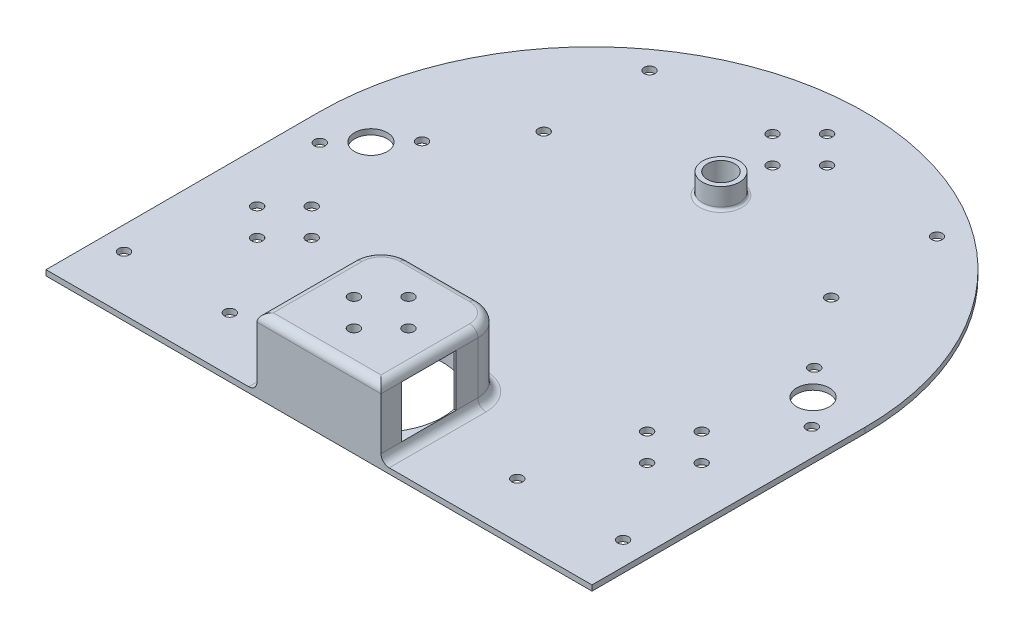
ISO-10303-21;
HEADER;
FILE_DESCRIPTION(('STEP AP214'),'2;1');
FILE_NAME('part.step','',(''),(''),'','','');
FILE_SCHEMA(('AUTOMOTIVE_DESIGN { 1 0 10303 214 1 1 1 1 }'));
ENDSEC;
DATA;
#1=APPLICATION_CONTEXT('core data for automotive mechanical design processes');
#2=APPLICATION_PROTOCOL_DEFINITION('international standard','automotive_design',2000,#1);
#3=PRODUCT_CONTEXT('',#1,'mechanical');
#4=PRODUCT('Part','Part','',(#3));
#5=PRODUCT_RELATED_PRODUCT_CATEGORY('part','',(#4));
#6=PRODUCT_DEFINITION_FORMATION('','',#4);
#7=PRODUCT_DEFINITION_CONTEXT('part definition',#1,'design');
#8=PRODUCT_DEFINITION('design','',#6,#7);
#9=PRODUCT_DEFINITION_SHAPE('','',#8);
#10=(LENGTH_UNIT() NAMED_UNIT(*) SI_UNIT(.MILLI.,.METRE.));
#11=(NAMED_UNIT(*) PLANE_ANGLE_UNIT() SI_UNIT($,.RADIAN.));
#12=(NAMED_UNIT(*) SI_UNIT($,.STERADIAN.) SOLID_ANGLE_UNIT());
#13=UNCERTAINTY_MEASURE_WITH_UNIT(LENGTH_MEASURE(1.E-05),#10,'distance_accuracy_value','');
#14=(GEOMETRIC_REPRESENTATION_CONTEXT(3) GLOBAL_UNCERTAINTY_ASSIGNED_CONTEXT((#13)) GLOBAL_UNIT_ASSIGNED_CONTEXT((#10,
#11,#12)) REPRESENTATION_CONTEXT('',''));
#15=CARTESIAN_POINT('',(0.,0.,0.));
#16=DIRECTION('',(0.,0.,1.));
#17=DIRECTION('',(1.,0.,0.));
#18=AXIS2_PLACEMENT_3D('',#15,#16,#17);
#19=CARTESIAN_POINT('',(-22.75,27.,64.6));
#20=DIRECTION('',(1.,0.,0.));
#21=DIRECTION('',(0.,0.,-1.));
#22=AXIS2_PLACEMENT_3D('',#19,#20,#21);
#23=PLANE('',#22);
#24=DIRECTION('',(0.,0.,1.));
#25=VECTOR('',#24,1.);
#26=CARTESIAN_POINT('',(-22.75,24.,64.6));
#27=LINE('',#26,#25);
#28=CARTESIAN_POINT('',(-22.75,24.,100.1));
#29=VERTEX_POINT('',#28);
#30=CARTESIAN_POINT('',(-22.75,24.,92.6000000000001));
#31=VERTEX_POINT('',#30);
#32=EDGE_CURVE('E423',#29,#31,#27,.F.);
#33=ORIENTED_EDGE('',*,*,#32,.T.);
#34=DIRECTION('',(0.,-1.,0.));
#35=VECTOR('',#34,1.);
#36=CARTESIAN_POINT('',(-22.75,27.,92.6));
#37=LINE('',#36,#35);
#38=CARTESIAN_POINT('',(-22.75,5.,92.6));
#39=VERTEX_POINT('',#38);
#40=EDGE_CURVE('E765',#31,#39,#37,.T.);
#41=ORIENTED_EDGE('',*,*,#40,.T.);
#42=DIRECTION('',(0.,0.,1.));
#43=VECTOR('',#42,1.);
#44=CARTESIAN_POINT('',(-22.75,5.,64.6));
#45=LINE('',#44,#43);
#46=CARTESIAN_POINT('',(-22.75,5.,100.1));
#47=VERTEX_POINT('',#46);
#48=EDGE_CURVE('E420',#39,#47,#45,.T.);
#49=ORIENTED_EDGE('',*,*,#48,.T.);
#50=DIRECTION('',(0.,-1.,0.));
#51=VECTOR('',#50,1.);
#52=CARTESIAN_POINT('',(-22.75,27.,100.1));
#53=LINE('',#52,#51);
#54=EDGE_CURVE('E687',#29,#47,#53,.T.);
#55=ORIENTED_EDGE('',*,*,#54,.F.);
#56=EDGE_LOOP('',(#33,#41,#49,#55));
#57=FACE_BOUND('',#56,.T.);
#58=ADVANCED_FACE('F54',(#57),#23,.F.);
#59=CARTESIAN_POINT('',(22.75,27.,64.6));
#60=DIRECTION('',(-1.,0.,0.));
#61=DIRECTION('',(0.,0.,1.));
#62=AXIS2_PLACEMENT_3D('',#59,#60,#61);
#63=PLANE('',#62);
#64=DIRECTION('',(0.,0.,-1.));
#65=VECTOR('',#64,1.);
#66=CARTESIAN_POINT('',(22.75,5.,64.6));
#67=LINE('',#66,#65);
#68=CARTESIAN_POINT('',(22.75,5.,100.1));
#69=VERTEX_POINT('',#68);
#70=CARTESIAN_POINT('',(22.75,5.,92.6));
#71=VERTEX_POINT('',#70);
#72=EDGE_CURVE('E249',#69,#71,#67,.T.);
#73=ORIENTED_EDGE('',*,*,#72,.T.);
#74=DIRECTION('',(0.,-1.,0.));
#75=VECTOR('',#74,1.);
#76=CARTESIAN_POINT('',(22.75,24.,92.6));
#77=LINE('',#76,#75);
#78=CARTESIAN_POINT('',(22.75,24.,92.6));
#79=VERTEX_POINT('',#78);
#80=EDGE_CURVE('E234',#79,#71,#77,.T.);
#81=ORIENTED_EDGE('',*,*,#80,.F.);
#82=DIRECTION('',(0.,0.,-1.));
#83=VECTOR('',#82,1.);
#84=CARTESIAN_POINT('',(22.75,24.,64.6));
#85=LINE('',#84,#83);
#86=CARTESIAN_POINT('',(22.75,24.,100.1));
#87=VERTEX_POINT('',#86);
#88=EDGE_CURVE('E419',#79,#87,#85,.F.);
#89=ORIENTED_EDGE('',*,*,#88,.T.);
#90=DIRECTION('',(0.,-1.,0.));
#91=VECTOR('',#90,1.);
#92=CARTESIAN_POINT('',(22.75,27.,100.1));
#93=LINE('',#92,#91);
#94=EDGE_CURVE('E257',#87,#69,#93,.T.);
#95=ORIENTED_EDGE('',*,*,#94,.T.);
#96=EDGE_LOOP('',(#73,#81,#89,#95));
#97=FACE_BOUND('',#96,.T.);
#98=ADVANCED_FACE('F255',(#97),#63,.F.);
#99=CARTESIAN_POINT('',(0.,23.,77.297461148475));
#100=DIRECTION('',(0.,-1.,0.));
#101=DIRECTION('',(0.,0.,-1.));
#102=AXIS2_PLACEMENT_3D('',#99,#100,#101);
#103=PLANE('',#102);
#104=DIRECTION('',(-1.,0.,0.));
#105=VECTOR('',#104,1.);
#106=CARTESIAN_POINT('',(0.,23.,92.6));
#107=LINE('',#106,#105);
#108=CARTESIAN_POINT('',(16.4949175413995,23.,92.6));
#109=VERTEX_POINT('',#108);
#110=CARTESIAN_POINT('',(-16.4949175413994,23.,92.6));
#111=VERTEX_POINT('',#110);
#112=EDGE_CURVE('E776',#109,#111,#107,.T.);
#113=ORIENTED_EDGE('',*,*,#112,.F.);
#114=CARTESIAN_POINT('',(0.,23.,77.297461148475));
#115=DIRECTION('',(0.,-1.,0.));
#116=DIRECTION('',(0.,0.,-1.));
#117=AXIS2_PLACEMENT_3D('',#114,#115,#116);
#118=CIRCLE('',#117,22.5);
#119=EDGE_CURVE('E705',#109,#111,#118,.T.);
#120=ORIENTED_EDGE('',*,*,#119,.T.);
#121=EDGE_LOOP('',(#113,#120));
#122=FACE_BOUND('',#121,.T.);
#123=ADVANCED_FACE('F389',(#122),#103,.T.);
#124=CARTESIAN_POINT('',(0.,2.,0.));
#125=DIRECTION('',(0.,1.,0.));
#126=DIRECTION('',(0.,0.,1.));
#127=AXIS2_PLACEMENT_3D('',#124,#125,#126);
#128=PLANE('',#127);
#129=CARTESIAN_POINT('',(-91.5,2.,80.1));
#130=DIRECTION('',(0.,1.,0.));
#131=DIRECTION('',(0.,0.,1.));
#132=AXIS2_PLACEMENT_3D('',#129,#130,#131);
#133=CIRCLE('',#132,2.);
#134=CARTESIAN_POINT('',(-91.5,2.,82.1));
#135=VERTEX_POINT('',#134);
#136=EDGE_CURVE('E334',#135,#135,#133,.T.);
#137=ORIENTED_EDGE('',*,*,#136,.F.);
#138=EDGE_LOOP('',(#137));
#139=FACE_BOUND('',#138,.T.);
#140=CARTESIAN_POINT('',(52.7,2.,-73.8));
#141=DIRECTION('',(0.,1.,0.));
#142=DIRECTION('',(0.,0.,-1.));
#143=AXIS2_PLACEMENT_3D('',#140,#141,#142);
#144=CIRCLE('',#143,2.);
#145=CARTESIAN_POINT('',(52.7,2.,-75.8));
#146=VERTEX_POINT('',#145);
#147=EDGE_CURVE('E746',#146,#146,#144,.T.);
#148=ORIENTED_EDGE('',*,*,#147,.F.);
#149=EDGE_LOOP('',(#148));
#150=FACE_BOUND('',#149,.T.);
#151=CARTESIAN_POINT('',(52.7,2.,-35.));
#152=DIRECTION('',(0.,1.,0.));
#153=DIRECTION('',(0.,0.,-1.));
#154=AXIS2_PLACEMENT_3D('',#151,#152,#153);
#155=CIRCLE('',#154,2.);
#156=CARTESIAN_POINT('',(52.7,2.,-37.));
#157=VERTEX_POINT('',#156);
#158=EDGE_CURVE('E750',#157,#157,#155,.T.);
#159=ORIENTED_EDGE('',*,*,#158,.F.);
#160=EDGE_LOOP('',(#159));
#161=FACE_BOUND('',#160,.T.);
#162=CARTESIAN_POINT('',(-52.7,2.,-35.));
#163=DIRECTION('',(0.,1.,0.));
#164=DIRECTION('',(0.,0.,1.));
#165=AXIS2_PLACEMENT_3D('',#162,#163,#164);
#166=CIRCLE('',#165,2.);
#167=CARTESIAN_POINT('',(-52.7,2.,-33.));
#168=VERTEX_POINT('',#167);
#169=EDGE_CURVE('E742',#168,#168,#166,.T.);
#170=ORIENTED_EDGE('',*,*,#169,.F.);
#171=EDGE_LOOP('',(#170));
#172=FACE_BOUND('',#171,.T.);
#173=CARTESIAN_POINT('',(-52.7,2.,80.1));
#174=DIRECTION('',(0.,1.,0.));
#175=DIRECTION('',(0.,0.,1.));
#176=AXIS2_PLACEMENT_3D('',#173,#174,#175);
#177=CIRCLE('',#176,2.);
#178=CARTESIAN_POINT('',(-52.7,2.,82.1));
#179=VERTEX_POINT('',#178);
#180=EDGE_CURVE('E733',#179,#179,#177,.T.);
#181=ORIENTED_EDGE('',*,*,#180,.F.);
#182=EDGE_LOOP('',(#181));
#183=FACE_BOUND('',#182,.T.);
#184=CARTESIAN_POINT('',(52.7,2.,80.1));
#185=DIRECTION('',(0.,1.,0.));
#186=DIRECTION('',(0.,0.,-1.));
#187=AXIS2_PLACEMENT_3D('',#184,#185,#186);
#188=CIRCLE('',#187,2.);
#189=CARTESIAN_POINT('',(52.7,2.,78.1));
#190=VERTEX_POINT('',#189);
#191=EDGE_CURVE('E729',#190,#190,#188,.T.);
#192=ORIENTED_EDGE('',*,*,#191,.F.);
#193=EDGE_LOOP('',(#192));
#194=FACE_BOUND('',#193,.T.);
#195=CARTESIAN_POINT('',(91.5,2.,80.1));
#196=DIRECTION('',(0.,1.,0.));
#197=DIRECTION('',(0.,0.,-1.));
#198=AXIS2_PLACEMENT_3D('',#195,#196,#197);
#199=CIRCLE('',#198,2.);
#200=CARTESIAN_POINT('',(91.5,2.,78.1));
#201=VERTEX_POINT('',#200);
#202=EDGE_CURVE('E734',#201,#201,#199,.T.);
#203=ORIENTED_EDGE('',*,*,#202,.F.);
#204=EDGE_LOOP('',(#203));
#205=FACE_BOUND('',#204,.T.);
#206=CARTESIAN_POINT('',(-52.7,2.,-73.8));
#207=DIRECTION('',(0.,1.,0.));
#208=DIRECTION('',(0.,0.,1.));
#209=AXIS2_PLACEMENT_3D('',#206,#207,#208);
#210=CIRCLE('',#209,2.);
#211=CARTESIAN_POINT('',(-52.7,2.,-71.8));
#212=VERTEX_POINT('',#211);
#213=EDGE_CURVE('E738',#212,#212,#210,.T.);
#214=ORIENTED_EDGE('',*,*,#213,.F.);
#215=EDGE_LOOP('',(#214));
#216=FACE_BOUND('',#215,.T.);
#217=CARTESIAN_POINT('',(0.,2.,-47.3));
#218=DIRECTION('',(0.,1.,0.));
#219=DIRECTION('',(0.,0.,1.));
#220=AXIS2_PLACEMENT_3D('',#217,#218,#219);
#221=CIRCLE('',#220,7.75);
#222=CARTESIAN_POINT('',(0.,2.,-39.55));
#223=VERTEX_POINT('',#222);
#224=EDGE_CURVE('E280',#223,#223,#221,.F.);
#225=ORIENTED_EDGE('',*,*,#224,.T.);
#226=EDGE_LOOP('',(#225));
#227=FACE_BOUND('',#226,.T.);
#228=DIRECTION('',(1.,0.,0.));
#229=VECTOR('',#228,1.);
#230=CARTESIAN_POINT('',(-100.1,2.,100.1));
#231=LINE('',#230,#229);
#232=CARTESIAN_POINT('',(-100.1,2.,100.1));
#233=VERTEX_POINT('',#232);
#234=CARTESIAN_POINT('',(-25.75,2.,100.1));
#235=VERTEX_POINT('',#234);
#236=EDGE_CURVE('E590',#233,#235,#231,.T.);
#237=ORIENTED_EDGE('',*,*,#236,.T.);
#238=DIRECTION('',(0.,0.,1.));
#239=VECTOR('',#238,1.);
#240=CARTESIAN_POINT('',(-25.7499999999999,2.,0.));
#241=LINE('',#240,#239);
#242=CARTESIAN_POINT('',(-25.75,2.,64.6));
#243=VERTEX_POINT('',#242);
#244=EDGE_CURVE('E455',#235,#243,#241,.F.);
#245=ORIENTED_EDGE('',*,*,#244,.T.);
#246=CARTESIAN_POINT('',(-12.75,2.,64.6));
#247=DIRECTION('',(0.,1.,0.));
#248=DIRECTION('',(0.,0.,1.));
#249=AXIS2_PLACEMENT_3D('',#246,#247,#248);
#250=CIRCLE('',#249,13.);
#251=CARTESIAN_POINT('',(-12.75,2.,51.6));
#252=VERTEX_POINT('',#251);
#253=EDGE_CURVE('E464',#243,#252,#250,.F.);
#254=ORIENTED_EDGE('',*,*,#253,.T.);
#255=DIRECTION('',(-1.,0.,0.));
#256=VECTOR('',#255,1.);
#257=CARTESIAN_POINT('',(0.,2.,51.6));
#258=LINE('',#257,#256);
#259=CARTESIAN_POINT('',(12.75,2.,51.6));
#260=VERTEX_POINT('',#259);
#261=EDGE_CURVE('E467',#252,#260,#258,.F.);
#262=ORIENTED_EDGE('',*,*,#261,.T.);
#263=CARTESIAN_POINT('',(12.75,2.,64.6));
#264=DIRECTION('',(0.,1.,0.));
#265=DIRECTION('',(0.,0.,1.));
#266=AXIS2_PLACEMENT_3D('',#263,#264,#265);
#267=CIRCLE('',#266,13.);
#268=CARTESIAN_POINT('',(25.75,2.,64.6));
#269=VERTEX_POINT('',#268);
#270=EDGE_CURVE('E461',#260,#269,#267,.F.);
#271=ORIENTED_EDGE('',*,*,#270,.T.);
#272=DIRECTION('',(0.,0.,-1.));
#273=VECTOR('',#272,1.);
#274=CARTESIAN_POINT('',(25.7499999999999,2.,0.));
#275=LINE('',#274,#273);
#276=CARTESIAN_POINT('',(25.75,2.,100.1));
#277=VERTEX_POINT('',#276);
#278=EDGE_CURVE('E458',#269,#277,#275,.F.);
#279=ORIENTED_EDGE('',*,*,#278,.T.);
#280=CARTESIAN_POINT('',(100.1,2.,100.1));
#281=VERTEX_POINT('',#280);
#282=EDGE_CURVE('E594',#277,#281,#231,.T.);
#283=ORIENTED_EDGE('',*,*,#282,.T.);
#284=DIRECTION('',(0.,0.,-1.));
#285=VECTOR('',#284,1.);
#286=CARTESIAN_POINT('',(100.1,2.,100.1));
#287=LINE('',#286,#285);
#288=CARTESIAN_POINT('',(100.1,2.,0.));
#289=VERTEX_POINT('',#288);
#290=EDGE_CURVE('E574',#281,#289,#287,.T.);
#291=ORIENTED_EDGE('',*,*,#290,.T.);
#292=CARTESIAN_POINT('',(0.,2.,0.));
#293=DIRECTION('',(0.,1.,0.));
#294=DIRECTION('',(0.,0.,1.));
#295=AXIS2_PLACEMENT_3D('',#292,#293,#294);
#296=CIRCLE('',#295,100.1);
#297=CARTESIAN_POINT('',(-100.1,2.,0.));
#298=VERTEX_POINT('',#297);
#299=EDGE_CURVE('E578',#289,#298,#296,.T.);
#300=ORIENTED_EDGE('',*,*,#299,.T.);
#301=DIRECTION('',(0.,0.,1.));
#302=VECTOR('',#301,1.);
#303=CARTESIAN_POINT('',(-100.1,2.,0.));
#304=LINE('',#303,#302);
#305=EDGE_CURVE('E595',#298,#233,#304,.T.);
#306=ORIENTED_EDGE('',*,*,#305,.T.);
#307=EDGE_LOOP('',(#237,#245,#254,#262,#271,#279,#283,#291,#300,#306));
#308=FACE_BOUND('',#307,.T.);
#309=CARTESIAN_POINT('',(-81.4903970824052,2.,41.2750000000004));
#310=DIRECTION('',(0.,1.,0.));
#311=DIRECTION('',(0.,0.,1.));
#312=AXIS2_PLACEMENT_3D('',#309,#310,#311);
#313=CIRCLE('',#312,2.);
#314=CARTESIAN_POINT('',(-81.4903970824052,2.,43.2750000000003));
#315=VERTEX_POINT('',#314);
#316=EDGE_CURVE('E626',#315,#315,#313,.T.);
#317=ORIENTED_EDGE('',*,*,#316,.F.);
#318=EDGE_LOOP('',(#317));
#319=FACE_BOUND('',#318,.T.);
#320=CARTESIAN_POINT('',(0.,2.,-66.2));
#321=DIRECTION('',(0.,1.,0.));
#322=DIRECTION('',(0.,0.,1.));
#323=AXIS2_PLACEMENT_3D('',#320,#321,#322);
#324=CIRCLE('',#323,2.);
#325=CARTESIAN_POINT('',(0.,2.,-64.2));
#326=VERTEX_POINT('',#325);
#327=EDGE_CURVE('E604',#326,#326,#324,.T.);
#328=ORIENTED_EDGE('',*,*,#327,.F.);
#329=EDGE_LOOP('',(#328));
#330=FACE_BOUND('',#329,.T.);
#331=CARTESIAN_POINT('',(10.,2.,-76.2));
#332=DIRECTION('',(0.,1.,0.));
#333=DIRECTION('',(0.,0.,1.));
#334=AXIS2_PLACEMENT_3D('',#331,#332,#333);
#335=CIRCLE('',#334,2.);
#336=CARTESIAN_POINT('',(10.,2.,-74.2));
#337=VERTEX_POINT('',#336);
#338=EDGE_CURVE('E605',#337,#337,#335,.T.);
#339=ORIENTED_EDGE('',*,*,#338,.F.);
#340=EDGE_LOOP('',(#339));
#341=FACE_BOUND('',#340,.T.);
#342=CARTESIAN_POINT('',(0.,2.,-86.2));
#343=DIRECTION('',(0.,1.,0.));
#344=DIRECTION('',(0.,0.,1.));
#345=AXIS2_PLACEMENT_3D('',#342,#343,#344);
#346=CIRCLE('',#345,2.);
#347=CARTESIAN_POINT('',(0.,2.,-84.2));
#348=VERTEX_POINT('',#347);
#349=EDGE_CURVE('E609',#348,#348,#346,.T.);
#350=ORIENTED_EDGE('',*,*,#349,.F.);
#351=EDGE_LOOP('',(#350));
#352=FACE_BOUND('',#351,.T.);
#353=CARTESIAN_POINT('',(71.4903970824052,2.,31.2750000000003));
#354=DIRECTION('',(0.,1.,0.));
#355=DIRECTION('',(0.,0.,1.));
#356=AXIS2_PLACEMENT_3D('',#353,#354,#355);
#357=CIRCLE('',#356,2.);
#358=CARTESIAN_POINT('',(71.4903970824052,2.,33.2750000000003));
#359=VERTEX_POINT('',#358);
#360=EDGE_CURVE('E613',#359,#359,#357,.T.);
#361=ORIENTED_EDGE('',*,*,#360,.F.);
#362=EDGE_LOOP('',(#361));
#363=FACE_BOUND('',#362,.T.);
#364=CARTESIAN_POINT('',(-10.,2.,-76.2));
#365=DIRECTION('',(0.,1.,0.));
#366=DIRECTION('',(0.,0.,1.));
#367=AXIS2_PLACEMENT_3D('',#364,#365,#366);
#368=CIRCLE('',#367,2.);
#369=CARTESIAN_POINT('',(-10.,2.,-74.2));
#370=VERTEX_POINT('',#369);
#371=EDGE_CURVE('E558',#370,#370,#368,.T.);
#372=ORIENTED_EDGE('',*,*,#371,.F.);
#373=EDGE_LOOP('',(#372));
#374=FACE_BOUND('',#373,.T.);
#375=CARTESIAN_POINT('',(81.05,2.,0.));
#376=DIRECTION('',(0.,1.,0.));
#377=DIRECTION('',(0.,0.,1.));
#378=AXIS2_PLACEMENT_3D('',#375,#376,#377);
#379=CIRCLE('',#378,6.);
#380=CARTESIAN_POINT('',(81.05,2.,6.));
#381=VERTEX_POINT('',#380);
#382=EDGE_CURVE('E638',#381,#381,#379,.T.);
#383=ORIENTED_EDGE('',*,*,#382,.F.);
#384=EDGE_LOOP('',(#383));
#385=FACE_BOUND('',#384,.T.);
#386=CARTESIAN_POINT('',(71.4903970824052,2.,51.2750000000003));
#387=DIRECTION('',(0.,1.,0.));
#388=DIRECTION('',(0.,0.,1.));
#389=AXIS2_PLACEMENT_3D('',#386,#387,#388);
#390=CIRCLE('',#389,2.);
#391=CARTESIAN_POINT('',(71.4903970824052,2.,53.2750000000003));
#392=VERTEX_POINT('',#391);
#393=EDGE_CURVE('E643',#392,#392,#390,.T.);
#394=ORIENTED_EDGE('',*,*,#393,.F.);
#395=EDGE_LOOP('',(#394));
#396=FACE_BOUND('',#395,.T.);
#397=CARTESIAN_POINT('',(81.4903970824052,2.,41.2750000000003));
#398=DIRECTION('',(0.,1.,0.));
#399=DIRECTION('',(0.,0.,1.));
#400=AXIS2_PLACEMENT_3D('',#397,#398,#399);
#401=CIRCLE('',#400,2.);
#402=CARTESIAN_POINT('',(81.4903970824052,2.,43.2750000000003));
#403=VERTEX_POINT('',#402);
#404=EDGE_CURVE('E639',#403,#403,#401,.T.);
#405=ORIENTED_EDGE('',*,*,#404,.F.);
#406=EDGE_LOOP('',(#405));
#407=FACE_BOUND('',#406,.T.);
#408=CARTESIAN_POINT('',(61.4903970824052,2.,41.2750000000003));
#409=DIRECTION('',(0.,1.,0.));
#410=DIRECTION('',(0.,0.,1.));
#411=AXIS2_PLACEMENT_3D('',#408,#409,#410);
#412=CIRCLE('',#411,2.);
#413=CARTESIAN_POINT('',(61.4903970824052,2.,43.2750000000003));
#414=VERTEX_POINT('',#413);
#415=EDGE_CURVE('E617',#414,#414,#412,.T.);
#416=ORIENTED_EDGE('',*,*,#415,.F.);
#417=EDGE_LOOP('',(#416));
#418=FACE_BOUND('',#417,.T.);
#419=CARTESIAN_POINT('',(-81.05,2.,0.));
#420=DIRECTION('',(0.,1.,0.));
#421=DIRECTION('',(0.,0.,1.));
#422=AXIS2_PLACEMENT_3D('',#419,#420,#421);
#423=CIRCLE('',#422,6.);
#424=CARTESIAN_POINT('',(-81.05,2.,6.));
#425=VERTEX_POINT('',#424);
#426=EDGE_CURVE('E634',#425,#425,#423,.T.);
#427=ORIENTED_EDGE('',*,*,#426,.F.);
#428=EDGE_LOOP('',(#427));
#429=FACE_BOUND('',#428,.T.);
#430=CARTESIAN_POINT('',(-71.4903970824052,2.,31.2750000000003));
#431=DIRECTION('',(0.,1.,0.));
#432=DIRECTION('',(0.,0.,1.));
#433=AXIS2_PLACEMENT_3D('',#430,#431,#432);
#434=CIRCLE('',#433,2.);
#435=CARTESIAN_POINT('',(-71.4903970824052,2.,33.2750000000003));
#436=VERTEX_POINT('',#435);
#437=EDGE_CURVE('E630',#436,#436,#434,.T.);
#438=ORIENTED_EDGE('',*,*,#437,.F.);
#439=EDGE_LOOP('',(#438));
#440=FACE_BOUND('',#439,.T.);
#441=CARTESIAN_POINT('',(-61.4903970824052,2.,41.2750000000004));
#442=DIRECTION('',(0.,1.,0.));
#443=DIRECTION('',(0.,0.,1.));
#444=AXIS2_PLACEMENT_3D('',#441,#442,#443);
#445=CIRCLE('',#444,2.);
#446=CARTESIAN_POINT('',(-61.4903970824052,2.,43.2750000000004));
#447=VERTEX_POINT('',#446);
#448=EDGE_CURVE('E625',#447,#447,#445,.T.);
#449=ORIENTED_EDGE('',*,*,#448,.F.);
#450=EDGE_LOOP('',(#449));
#451=FACE_BOUND('',#450,.T.);
#452=CARTESIAN_POINT('',(-71.4903970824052,2.,51.2750000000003));
#453=DIRECTION('',(0.,1.,0.));
#454=DIRECTION('',(0.,0.,1.));
#455=AXIS2_PLACEMENT_3D('',#452,#453,#454);
#456=CIRCLE('',#455,2.);
#457=CARTESIAN_POINT('',(-71.4903970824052,2.,53.2750000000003));
#458=VERTEX_POINT('',#457);
#459=EDGE_CURVE('E621',#458,#458,#456,.T.);
#460=ORIENTED_EDGE('',*,*,#459,.F.);
#461=EDGE_LOOP('',(#460));
#462=FACE_BOUND('',#461,.T.);
#463=CARTESIAN_POINT('',(-71.9054342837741,2.,-9.58850446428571));
#464=DIRECTION('',(0.,1.,0.));
#465=DIRECTION('',(0.,0.,1.));
#466=AXIS2_PLACEMENT_3D('',#463,#464,#465);
#467=CIRCLE('',#466,2.);
#468=CARTESIAN_POINT('',(-71.9054342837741,2.,-7.58850446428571));
#469=VERTEX_POINT('',#468);
#470=EDGE_CURVE('E500',#469,#469,#467,.T.);
#471=ORIENTED_EDGE('',*,*,#470,.F.);
#472=EDGE_LOOP('',(#471));
#473=FACE_BOUND('',#472,.T.);
#474=CARTESIAN_POINT('',(-90.1945657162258,2.,9.58850446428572));
#475=DIRECTION('',(0.,1.,0.));
#476=DIRECTION('',(0.,0.,1.));
#477=AXIS2_PLACEMENT_3D('',#474,#475,#476);
#478=CIRCLE('',#477,2.);
#479=CARTESIAN_POINT('',(-90.1945657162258,2.,11.5885044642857));
#480=VERTEX_POINT('',#479);
#481=EDGE_CURVE('E674',#480,#480,#478,.T.);
#482=ORIENTED_EDGE('',*,*,#481,.F.);
#483=EDGE_LOOP('',(#482));
#484=FACE_BOUND('',#483,.T.);
#485=CARTESIAN_POINT('',(71.9054342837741,2.,-9.58850446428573));
#486=DIRECTION('',(0.,1.,0.));
#487=DIRECTION('',(0.,0.,1.));
#488=AXIS2_PLACEMENT_3D('',#485,#486,#487);
#489=CIRCLE('',#488,2.);
#490=CARTESIAN_POINT('',(71.9054342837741,2.,-7.58850446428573));
#491=VERTEX_POINT('',#490);
#492=EDGE_CURVE('E678',#491,#491,#489,.T.);
#493=ORIENTED_EDGE('',*,*,#492,.F.);
#494=EDGE_LOOP('',(#493));
#495=FACE_BOUND('',#494,.T.);
#496=CARTESIAN_POINT('',(90.1945657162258,2.,9.5885044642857));
#497=DIRECTION('',(0.,1.,0.));
#498=DIRECTION('',(0.,0.,1.));
#499=AXIS2_PLACEMENT_3D('',#496,#497,#498);
#500=CIRCLE('',#499,2.);
#501=CARTESIAN_POINT('',(90.1945657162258,2.,11.5885044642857));
#502=VERTEX_POINT('',#501);
#503=EDGE_CURVE('E482',#502,#502,#500,.T.);
#504=ORIENTED_EDGE('',*,*,#503,.F.);
#505=EDGE_LOOP('',(#504));
#506=FACE_BOUND('',#505,.T.);
#507=ADVANCED_FACE('F867',(#139,#150,#161,#172,#183,#194,#205,#216,#227,#308,#319,#330,#341,
#352,#363,#374,#385,#396,#407,#418,#429,#440,#451,#462,#473,#484,#495,#506),#128,.T.);
#508=CARTESIAN_POINT('',(0.,0.,0.));
#509=DIRECTION('',(0.,1.,0.));
#510=DIRECTION('',(0.,0.,1.));
#511=AXIS2_PLACEMENT_3D('',#508,#509,#510);
#512=PLANE('',#511);
#513=CARTESIAN_POINT('',(-91.5,0.,80.1));
#514=DIRECTION('',(0.,1.,0.));
#515=DIRECTION('',(0.,0.,1.));
#516=AXIS2_PLACEMENT_3D('',#513,#514,#515);
#517=CIRCLE('',#516,2.);
#518=CARTESIAN_POINT('',(-91.5,0.,82.1));
#519=VERTEX_POINT('',#518);
#520=EDGE_CURVE('E58',#519,#519,#517,.T.);
#521=ORIENTED_EDGE('',*,*,#520,.T.);
#522=EDGE_LOOP('',(#521));
#523=FACE_BOUND('',#522,.T.);
#524=CARTESIAN_POINT('',(52.7,0.,-73.8));
#525=DIRECTION('',(0.,1.,0.));
#526=DIRECTION('',(0.,0.,1.));
#527=AXIS2_PLACEMENT_3D('',#524,#525,#526);
#528=CIRCLE('',#527,2.);
#529=CARTESIAN_POINT('',(52.7,0.,-71.8));
#530=VERTEX_POINT('',#529);
#531=EDGE_CURVE('E353',#530,#530,#528,.T.);
#532=ORIENTED_EDGE('',*,*,#531,.T.);
#533=EDGE_LOOP('',(#532));
#534=FACE_BOUND('',#533,.T.);
#535=CARTESIAN_POINT('',(52.7,0.,-35.));
#536=DIRECTION('',(0.,1.,0.));
#537=DIRECTION('',(0.,0.,1.));
#538=AXIS2_PLACEMENT_3D('',#535,#536,#537);
#539=CIRCLE('',#538,2.);
#540=CARTESIAN_POINT('',(52.7,0.,-33.));
#541=VERTEX_POINT('',#540);
#542=EDGE_CURVE('E350',#541,#541,#539,.T.);
#543=ORIENTED_EDGE('',*,*,#542,.T.);
#544=EDGE_LOOP('',(#543));
#545=FACE_BOUND('',#544,.T.);
#546=CARTESIAN_POINT('',(-52.7,0.,-35.));
#547=DIRECTION('',(0.,1.,0.));
#548=DIRECTION('',(0.,0.,1.));
#549=AXIS2_PLACEMENT_3D('',#546,#547,#548);
#550=CIRCLE('',#549,2.);
#551=CARTESIAN_POINT('',(-52.7,0.,-33.));
#552=VERTEX_POINT('',#551);
#553=EDGE_CURVE('E346',#552,#552,#550,.T.);
#554=ORIENTED_EDGE('',*,*,#553,.T.);
#555=EDGE_LOOP('',(#554));
#556=FACE_BOUND('',#555,.T.);
#557=CARTESIAN_POINT('',(-52.7,0.,80.1));
#558=DIRECTION('',(0.,1.,0.));
#559=DIRECTION('',(0.,0.,1.));
#560=AXIS2_PLACEMENT_3D('',#557,#558,#559);
#561=CIRCLE('',#560,2.);
#562=CARTESIAN_POINT('',(-52.7,0.,82.1));
#563=VERTEX_POINT('',#562);
#564=EDGE_CURVE('E342',#563,#563,#561,.T.);
#565=ORIENTED_EDGE('',*,*,#564,.T.);
#566=EDGE_LOOP('',(#565));
#567=FACE_BOUND('',#566,.T.);
#568=CARTESIAN_POINT('',(52.7,0.,80.1));
#569=DIRECTION('',(0.,1.,0.));
#570=DIRECTION('',(0.,0.,1.));
#571=AXIS2_PLACEMENT_3D('',#568,#569,#570);
#572=CIRCLE('',#571,2.);
#573=CARTESIAN_POINT('',(52.7,0.,82.1));
#574=VERTEX_POINT('',#573);
#575=EDGE_CURVE('E338',#574,#574,#572,.T.);
#576=ORIENTED_EDGE('',*,*,#575,.T.);
#577=EDGE_LOOP('',(#576));
#578=FACE_BOUND('',#577,.T.);
#579=CARTESIAN_POINT('',(91.5,0.,80.1));
#580=DIRECTION('',(0.,1.,0.));
#581=DIRECTION('',(0.,0.,1.));
#582=AXIS2_PLACEMENT_3D('',#579,#580,#581);
#583=CIRCLE('',#582,2.);
#584=CARTESIAN_POINT('',(91.5,0.,82.1));
#585=VERTEX_POINT('',#584);
#586=EDGE_CURVE('E333',#585,#585,#583,.T.);
#587=ORIENTED_EDGE('',*,*,#586,.T.);
#588=EDGE_LOOP('',(#587));
#589=FACE_BOUND('',#588,.T.);
#590=CARTESIAN_POINT('',(-52.7,0.,-73.8));
#591=DIRECTION('',(0.,1.,0.));
#592=DIRECTION('',(0.,0.,1.));
#593=AXIS2_PLACEMENT_3D('',#590,#591,#592);
#594=CIRCLE('',#593,2.);
#595=CARTESIAN_POINT('',(-52.7,0.,-71.8));
#596=VERTEX_POINT('',#595);
#597=EDGE_CURVE('E329',#596,#596,#594,.T.);
#598=ORIENTED_EDGE('',*,*,#597,.T.);
#599=EDGE_LOOP('',(#598));
#600=FACE_BOUND('',#599,.T.);
#601=CARTESIAN_POINT('',(0.,0.,-47.3));
#602=DIRECTION('',(0.,1.,0.));
#603=DIRECTION('',(0.,0.,1.));
#604=AXIS2_PLACEMENT_3D('',#601,#602,#603);
#605=CIRCLE('',#604,7.75);
#606=CARTESIAN_POINT('',(0.,0.,-39.55));
#607=VERTEX_POINT('',#606);
#608=EDGE_CURVE('E12',#607,#607,#605,.T.);
#609=ORIENTED_EDGE('',*,*,#608,.T.);
#610=EDGE_LOOP('',(#609));
#611=FACE_BOUND('',#610,.T.);
#612=CARTESIAN_POINT('',(0.,0.,77.297461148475));
#613=DIRECTION('',(0.,1.,0.));
#614=DIRECTION('',(0.,0.,1.));
#615=AXIS2_PLACEMENT_3D('',#612,#613,#614);
#616=CIRCLE('',#615,22.5);
#617=CARTESIAN_POINT('',(0.,0.,99.797461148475));
#618=VERTEX_POINT('',#617);
#619=EDGE_CURVE('E478',#618,#618,#616,.T.);
#620=ORIENTED_EDGE('',*,*,#619,.T.);
#621=EDGE_LOOP('',(#620));
#622=FACE_BOUND('',#621,.T.);
#623=CARTESIAN_POINT('',(90.1945657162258,0.,9.5885044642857));
#624=DIRECTION('',(0.,1.,0.));
#625=DIRECTION('',(0.,0.,1.));
#626=AXIS2_PLACEMENT_3D('',#623,#624,#625);
#627=CIRCLE('',#626,2.);
#628=CARTESIAN_POINT('',(90.1945657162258,0.,11.5885044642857));
#629=VERTEX_POINT('',#628);
#630=EDGE_CURVE('E483',#629,#629,#627,.T.);
#631=ORIENTED_EDGE('',*,*,#630,.T.);
#632=EDGE_LOOP('',(#631));
#633=FACE_BOUND('',#632,.T.);
#634=CARTESIAN_POINT('',(71.9054342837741,0.,-9.58850446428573));
#635=DIRECTION('',(0.,1.,0.));
#636=DIRECTION('',(0.,0.,1.));
#637=AXIS2_PLACEMENT_3D('',#634,#635,#636);
#638=CIRCLE('',#637,2.);
#639=CARTESIAN_POINT('',(71.9054342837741,0.,-7.58850446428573));
#640=VERTEX_POINT('',#639);
#641=EDGE_CURVE('E488',#640,#640,#638,.T.);
#642=ORIENTED_EDGE('',*,*,#641,.T.);
#643=EDGE_LOOP('',(#642));
#644=FACE_BOUND('',#643,.T.);
#645=CARTESIAN_POINT('',(-90.1945657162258,0.,9.58850446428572));
#646=DIRECTION('',(0.,1.,0.));
#647=DIRECTION('',(0.,0.,1.));
#648=AXIS2_PLACEMENT_3D('',#645,#646,#647);
#649=CIRCLE('',#648,2.);
#650=CARTESIAN_POINT('',(-90.1945657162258,0.,11.5885044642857));
#651=VERTEX_POINT('',#650);
#652=EDGE_CURVE('E492',#651,#651,#649,.T.);
#653=ORIENTED_EDGE('',*,*,#652,.T.);
#654=EDGE_LOOP('',(#653));
#655=FACE_BOUND('',#654,.T.);
#656=CARTESIAN_POINT('',(-71.9054342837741,0.,-9.58850446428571));
#657=DIRECTION('',(0.,1.,0.));
#658=DIRECTION('',(0.,0.,1.));
#659=AXIS2_PLACEMENT_3D('',#656,#657,#658);
#660=CIRCLE('',#659,2.);
#661=CARTESIAN_POINT('',(-71.9054342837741,0.,-7.58850446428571));
#662=VERTEX_POINT('',#661);
#663=EDGE_CURVE('E496',#662,#662,#660,.T.);
#664=ORIENTED_EDGE('',*,*,#663,.T.);
#665=EDGE_LOOP('',(#664));
#666=FACE_BOUND('',#665,.T.);
#667=CARTESIAN_POINT('',(0.,0.,0.));
#668=DIRECTION('',(0.,1.,0.));
#669=DIRECTION('',(0.,0.,1.));
#670=AXIS2_PLACEMENT_3D('',#667,#668,#669);
#671=CIRCLE('',#670,100.1);
#672=CARTESIAN_POINT('',(100.1,0.,0.));
#673=VERTEX_POINT('',#672);
#674=CARTESIAN_POINT('',(-100.1,0.,0.));
#675=VERTEX_POINT('',#674);
#676=EDGE_CURVE('E505',#673,#675,#671,.T.);
#677=ORIENTED_EDGE('',*,*,#676,.F.);
#678=DIRECTION('',(0.,0.,-1.));
#679=VECTOR('',#678,1.);
#680=CARTESIAN_POINT('',(100.1,0.,100.1));
#681=LINE('',#680,#679);
#682=CARTESIAN_POINT('',(100.1,0.,100.1));
#683=VERTEX_POINT('',#682);
#684=EDGE_CURVE('E575',#683,#673,#681,.T.);
#685=ORIENTED_EDGE('',*,*,#684,.F.);
#686=DIRECTION('',(1.,0.,0.));
#687=VECTOR('',#686,1.);
#688=CARTESIAN_POINT('',(-100.1,0.,100.1));
#689=LINE('',#688,#687);
#690=CARTESIAN_POINT('',(-100.1,0.,100.1));
#691=VERTEX_POINT('',#690);
#692=EDGE_CURVE('E579',#691,#683,#689,.T.);
#693=ORIENTED_EDGE('',*,*,#692,.F.);
#694=DIRECTION('',(0.,0.,1.));
#695=VECTOR('',#694,1.);
#696=CARTESIAN_POINT('',(-100.1,0.,0.));
#697=LINE('',#696,#695);
#698=EDGE_CURVE('E582',#675,#691,#697,.T.);
#699=ORIENTED_EDGE('',*,*,#698,.F.);
#700=EDGE_LOOP('',(#677,#685,#693,#699));
#701=FACE_BOUND('',#700,.T.);
#702=CARTESIAN_POINT('',(-71.4903970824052,0.,51.2750000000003));
#703=DIRECTION('',(0.,1.,0.));
#704=DIRECTION('',(0.,0.,1.));
#705=AXIS2_PLACEMENT_3D('',#702,#703,#704);
#706=CIRCLE('',#705,2.);
#707=CARTESIAN_POINT('',(-71.4903970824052,0.,53.2750000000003));
#708=VERTEX_POINT('',#707);
#709=EDGE_CURVE('E554',#708,#708,#706,.T.);
#710=ORIENTED_EDGE('',*,*,#709,.T.);
#711=EDGE_LOOP('',(#710));
#712=FACE_BOUND('',#711,.T.);
#713=CARTESIAN_POINT('',(-61.4903970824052,0.,41.2750000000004));
#714=DIRECTION('',(0.,1.,0.));
#715=DIRECTION('',(0.,0.,1.));
#716=AXIS2_PLACEMENT_3D('',#713,#714,#715);
#717=CIRCLE('',#716,2.);
#718=CARTESIAN_POINT('',(-61.4903970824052,0.,43.2750000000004));
#719=VERTEX_POINT('',#718);
#720=EDGE_CURVE('E550',#719,#719,#717,.T.);
#721=ORIENTED_EDGE('',*,*,#720,.T.);
#722=EDGE_LOOP('',(#721));
#723=FACE_BOUND('',#722,.T.);
#724=CARTESIAN_POINT('',(-71.4903970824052,0.,31.2750000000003));
#725=DIRECTION('',(0.,1.,0.));
#726=DIRECTION('',(0.,0.,1.));
#727=AXIS2_PLACEMENT_3D('',#724,#725,#726);
#728=CIRCLE('',#727,2.);
#729=CARTESIAN_POINT('',(-71.4903970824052,0.,33.2750000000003));
#730=VERTEX_POINT('',#729);
#731=EDGE_CURVE('E546',#730,#730,#728,.T.);
#732=ORIENTED_EDGE('',*,*,#731,.T.);
#733=EDGE_LOOP('',(#732));
#734=FACE_BOUND('',#733,.T.);
#735=CARTESIAN_POINT('',(-81.05,0.,0.));
#736=DIRECTION('',(0.,1.,0.));
#737=DIRECTION('',(0.,0.,1.));
#738=AXIS2_PLACEMENT_3D('',#735,#736,#737);
#739=CIRCLE('',#738,6.);
#740=CARTESIAN_POINT('',(-81.05,0.,6.));
#741=VERTEX_POINT('',#740);
#742=EDGE_CURVE('E542',#741,#741,#739,.T.);
#743=ORIENTED_EDGE('',*,*,#742,.T.);
#744=EDGE_LOOP('',(#743));
#745=FACE_BOUND('',#744,.T.);
#746=CARTESIAN_POINT('',(61.4903970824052,0.,41.2750000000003));
#747=DIRECTION('',(0.,1.,0.));
#748=DIRECTION('',(0.,0.,1.));
#749=AXIS2_PLACEMENT_3D('',#746,#747,#748);
#750=CIRCLE('',#749,2.);
#751=CARTESIAN_POINT('',(61.4903970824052,0.,43.2750000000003));
#752=VERTEX_POINT('',#751);
#753=EDGE_CURVE('E538',#752,#752,#750,.T.);
#754=ORIENTED_EDGE('',*,*,#753,.T.);
#755=EDGE_LOOP('',(#754));
#756=FACE_BOUND('',#755,.T.);
#757=CARTESIAN_POINT('',(81.4903970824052,0.,41.2750000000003));
#758=DIRECTION('',(0.,1.,0.));
#759=DIRECTION('',(0.,0.,1.));
#760=AXIS2_PLACEMENT_3D('',#757,#758,#759);
#761=CIRCLE('',#760,2.);
#762=CARTESIAN_POINT('',(81.4903970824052,0.,43.2750000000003));
#763=VERTEX_POINT('',#762);
#764=EDGE_CURVE('E534',#763,#763,#761,.T.);
#765=ORIENTED_EDGE('',*,*,#764,.T.);
#766=EDGE_LOOP('',(#765));
#767=FACE_BOUND('',#766,.T.);
#768=CARTESIAN_POINT('',(71.4903970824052,0.,51.2750000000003));
#769=DIRECTION('',(0.,1.,0.));
#770=DIRECTION('',(0.,0.,1.));
#771=AXIS2_PLACEMENT_3D('',#768,#769,#770);
#772=CIRCLE('',#771,2.);
#773=CARTESIAN_POINT('',(71.4903970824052,0.,53.2750000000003));
#774=VERTEX_POINT('',#773);
#775=EDGE_CURVE('E530',#774,#774,#772,.T.);
#776=ORIENTED_EDGE('',*,*,#775,.T.);
#777=EDGE_LOOP('',(#776));
#778=FACE_BOUND('',#777,.T.);
#779=CARTESIAN_POINT('',(81.05,0.,0.));
#780=DIRECTION('',(0.,1.,0.));
#781=DIRECTION('',(0.,0.,1.));
#782=AXIS2_PLACEMENT_3D('',#779,#780,#781);
#783=CIRCLE('',#782,6.);
#784=CARTESIAN_POINT('',(81.05,0.,6.));
#785=VERTEX_POINT('',#784);
#786=EDGE_CURVE('E526',#785,#785,#783,.T.);
#787=ORIENTED_EDGE('',*,*,#786,.T.);
#788=EDGE_LOOP('',(#787));
#789=FACE_BOUND('',#788,.T.);
#790=CARTESIAN_POINT('',(-10.,0.,-76.2));
#791=DIRECTION('',(0.,1.,0.));
#792=DIRECTION('',(0.,0.,1.));
#793=AXIS2_PLACEMENT_3D('',#790,#791,#792);
#794=CIRCLE('',#793,2.);
#795=CARTESIAN_POINT('',(-10.,0.,-74.2));
#796=VERTEX_POINT('',#795);
#797=EDGE_CURVE('E522',#796,#796,#794,.T.);
#798=ORIENTED_EDGE('',*,*,#797,.T.);
#799=EDGE_LOOP('',(#798));
#800=FACE_BOUND('',#799,.T.);
#801=CARTESIAN_POINT('',(71.4903970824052,0.,31.2750000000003));
#802=DIRECTION('',(0.,1.,0.));
#803=DIRECTION('',(0.,0.,1.));
#804=AXIS2_PLACEMENT_3D('',#801,#802,#803);
#805=CIRCLE('',#804,2.);
#806=CARTESIAN_POINT('',(71.4903970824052,0.,33.2750000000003));
#807=VERTEX_POINT('',#806);
#808=EDGE_CURVE('E518',#807,#807,#805,.T.);
#809=ORIENTED_EDGE('',*,*,#808,.T.);
#810=EDGE_LOOP('',(#809));
#811=FACE_BOUND('',#810,.T.);
#812=CARTESIAN_POINT('',(0.,0.,-86.2));
#813=DIRECTION('',(0.,1.,0.));
#814=DIRECTION('',(0.,0.,1.));
#815=AXIS2_PLACEMENT_3D('',#812,#813,#814);
#816=CIRCLE('',#815,2.);
#817=CARTESIAN_POINT('',(0.,0.,-84.2));
#818=VERTEX_POINT('',#817);
#819=EDGE_CURVE('E514',#818,#818,#816,.T.);
#820=ORIENTED_EDGE('',*,*,#819,.T.);
#821=EDGE_LOOP('',(#820));
#822=FACE_BOUND('',#821,.T.);
#823=CARTESIAN_POINT('',(10.,0.,-76.2));
#824=DIRECTION('',(0.,1.,0.));
#825=DIRECTION('',(0.,0.,1.));
#826=AXIS2_PLACEMENT_3D('',#823,#824,#825);
#827=CIRCLE('',#826,2.);
#828=CARTESIAN_POINT('',(10.,0.,-74.2));
#829=VERTEX_POINT('',#828);
#830=EDGE_CURVE('E510',#829,#829,#827,.T.);
#831=ORIENTED_EDGE('',*,*,#830,.T.);
#832=EDGE_LOOP('',(#831));
#833=FACE_BOUND('',#832,.T.);
#834=CARTESIAN_POINT('',(0.,0.,-66.2));
#835=DIRECTION('',(0.,1.,0.));
#836=DIRECTION('',(0.,0.,1.));
#837=AXIS2_PLACEMENT_3D('',#834,#835,#836);
#838=CIRCLE('',#837,2.);
#839=CARTESIAN_POINT('',(0.,0.,-64.2));
#840=VERTEX_POINT('',#839);
#841=EDGE_CURVE('E506',#840,#840,#838,.T.);
#842=ORIENTED_EDGE('',*,*,#841,.T.);
#843=EDGE_LOOP('',(#842));
#844=FACE_BOUND('',#843,.T.);
#845=CARTESIAN_POINT('',(-81.4903970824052,0.,41.2750000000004));
#846=DIRECTION('',(0.,1.,0.));
#847=DIRECTION('',(0.,0.,1.));
#848=AXIS2_PLACEMENT_3D('',#845,#846,#847);
#849=CIRCLE('',#848,2.);
#850=CARTESIAN_POINT('',(-81.4903970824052,0.,43.2750000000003));
#851=VERTEX_POINT('',#850);
#852=EDGE_CURVE('E501',#851,#851,#849,.T.);
#853=ORIENTED_EDGE('',*,*,#852,.T.);
#854=EDGE_LOOP('',(#853));
#855=FACE_BOUND('',#854,.T.);
#856=ADVANCED_FACE('F362',(#523,#534,#545,#556,#567,#578,#589,#600,#611,#622,#633,#644,#655,
#666,#701,#712,#723,#734,#745,#756,#767,#778,#789,#800,#811,#822,#833,#844,#855),#512,.F.);
#857=CARTESIAN_POINT('',(0.,2.,0.));
#858=DIRECTION('',(0.,-1.,0.));
#859=DIRECTION('',(0.,0.,-1.));
#860=AXIS2_PLACEMENT_3D('',#857,#858,#859);
#861=CYLINDRICAL_SURFACE('',#860,100.1);
#862=ORIENTED_EDGE('',*,*,#676,.T.);
#863=DIRECTION('',(0.,-1.,0.));
#864=VECTOR('',#863,1.);
#865=CARTESIAN_POINT('',(-100.1,2.,0.));
#866=LINE('',#865,#864);
#867=EDGE_CURVE('E477',#298,#675,#866,.T.);
#868=ORIENTED_EDGE('',*,*,#867,.F.);
#869=ORIENTED_EDGE('',*,*,#299,.F.);
#870=DIRECTION('',(0.,-1.,0.));
#871=VECTOR('',#870,1.);
#872=CARTESIAN_POINT('',(100.1,2.,0.));
#873=LINE('',#872,#871);
#874=EDGE_CURVE('E570',#289,#673,#873,.T.);
#875=ORIENTED_EDGE('',*,*,#874,.T.);
#876=EDGE_LOOP('',(#862,#868,#869,#875));
#877=FACE_BOUND('',#876,.T.);
#878=ADVANCED_FACE('F934',(#877),#861,.T.);
#879=CARTESIAN_POINT('',(-100.1,2.,0.));
#880=DIRECTION('',(1.,0.,0.));
#881=DIRECTION('',(0.,0.,-1.));
#882=AXIS2_PLACEMENT_3D('',#879,#880,#881);
#883=PLANE('',#882);
#884=ORIENTED_EDGE('',*,*,#698,.T.);
#885=DIRECTION('',(0.,-1.,0.));
#886=VECTOR('',#885,1.);
#887=CARTESIAN_POINT('',(-100.1,2.,100.1));
#888=LINE('',#887,#886);
#889=EDGE_CURVE('E562',#233,#691,#888,.T.);
#890=ORIENTED_EDGE('',*,*,#889,.F.);
#891=ORIENTED_EDGE('',*,*,#305,.F.);
#892=ORIENTED_EDGE('',*,*,#867,.T.);
#893=EDGE_LOOP('',(#884,#890,#891,#892));
#894=FACE_BOUND('',#893,.T.);
#895=ADVANCED_FACE('F953',(#894),#883,.F.);
#896=CARTESIAN_POINT('',(-100.1,2.,100.1));
#897=DIRECTION('',(0.,0.,-1.));
#898=DIRECTION('',(-1.,0.,0.));
#899=AXIS2_PLACEMENT_3D('',#896,#897,#898);
#900=PLANE('',#899);
#901=ORIENTED_EDGE('',*,*,#94,.F.);
#902=DIRECTION('',(1.,0.,0.));
#903=VECTOR('',#902,1.);
#904=CARTESIAN_POINT('',(-100.1,24.,100.1));
#905=LINE('',#904,#903);
#906=EDGE_CURVE('E271',#87,#29,#905,.F.);
#907=ORIENTED_EDGE('',*,*,#906,.T.);
#908=ORIENTED_EDGE('',*,*,#54,.T.);
#909=CARTESIAN_POINT('',(-25.75,5.,100.1));
#910=DIRECTION('',(0.,0.,-1.));
#911=DIRECTION('',(-1.,0.,0.));
#912=AXIS2_PLACEMENT_3D('',#909,#910,#911);
#913=CIRCLE('',#912,3.);
#914=EDGE_CURVE('E274',#47,#235,#913,.T.);
#915=ORIENTED_EDGE('',*,*,#914,.T.);
#916=ORIENTED_EDGE('',*,*,#236,.F.);
#917=ORIENTED_EDGE('',*,*,#889,.T.);
#918=ORIENTED_EDGE('',*,*,#692,.T.);
#919=DIRECTION('',(0.,-1.,0.));
#920=VECTOR('',#919,1.);
#921=CARTESIAN_POINT('',(100.1,2.,100.1));
#922=LINE('',#921,#920);
#923=EDGE_CURVE('E566',#281,#683,#922,.T.);
#924=ORIENTED_EDGE('',*,*,#923,.F.);
#925=ORIENTED_EDGE('',*,*,#282,.F.);
#926=CARTESIAN_POINT('',(25.75,5.,100.1));
#927=DIRECTION('',(0.,0.,-1.));
#928=DIRECTION('',(-1.,0.,0.));
#929=AXIS2_PLACEMENT_3D('',#926,#927,#928);
#930=CIRCLE('',#929,3.);
#931=EDGE_CURVE('E277',#277,#69,#930,.T.);
#932=ORIENTED_EDGE('',*,*,#931,.T.);
#933=EDGE_LOOP('',(#901,#907,#908,#915,#916,#917,#918,#924,#925,#932));
#934=FACE_BOUND('',#933,.T.);
#935=ADVANCED_FACE('F872',(#934),#900,.F.);
#936=CARTESIAN_POINT('',(100.1,2.,100.1));
#937=DIRECTION('',(-1.,0.,0.));
#938=DIRECTION('',(0.,0.,1.));
#939=AXIS2_PLACEMENT_3D('',#936,#937,#938);
#940=PLANE('',#939);
#941=ORIENTED_EDGE('',*,*,#684,.T.);
#942=ORIENTED_EDGE('',*,*,#874,.F.);
#943=ORIENTED_EDGE('',*,*,#290,.F.);
#944=ORIENTED_EDGE('',*,*,#923,.T.);
#945=EDGE_LOOP('',(#941,#942,#943,#944));
#946=FACE_BOUND('',#945,.T.);
#947=ADVANCED_FACE('F946',(#946),#940,.F.);
#948=CARTESIAN_POINT('',(-71.4903970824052,-3.,51.2750000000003));
#949=DIRECTION('',(0.,1.,0.));
#950=DIRECTION('',(0.,0.,1.));
#951=AXIS2_PLACEMENT_3D('',#948,#949,#950);
#952=CYLINDRICAL_SURFACE('',#951,2.);
#953=ORIENTED_EDGE('',*,*,#459,.T.);
#954=EDGE_LOOP('',(#953));
#955=FACE_BOUND('',#954,.T.);
#956=ORIENTED_EDGE('',*,*,#709,.F.);
#957=EDGE_LOOP('',(#956));
#958=FACE_BOUND('',#957,.T.);
#959=ADVANCED_FACE('F949',(#955,#958),#952,.F.);
#960=CARTESIAN_POINT('',(-61.4903970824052,-3.,41.2750000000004));
#961=DIRECTION('',(0.,1.,0.));
#962=DIRECTION('',(0.,0.,1.));
#963=AXIS2_PLACEMENT_3D('',#960,#961,#962);
#964=CYLINDRICAL_SURFACE('',#963,2.);
#965=ORIENTED_EDGE('',*,*,#448,.T.);
#966=EDGE_LOOP('',(#965));
#967=FACE_BOUND('',#966,.T.);
#968=ORIENTED_EDGE('',*,*,#720,.F.);
#969=EDGE_LOOP('',(#968));
#970=FACE_BOUND('',#969,.T.);
#971=ADVANCED_FACE('F1431',(#967,#970),#964,.F.);
#972=CARTESIAN_POINT('',(-71.4903970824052,-3.,31.2750000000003));
#973=DIRECTION('',(0.,1.,0.));
#974=DIRECTION('',(0.,0.,1.));
#975=AXIS2_PLACEMENT_3D('',#972,#973,#974);
#976=CYLINDRICAL_SURFACE('',#975,2.);
#977=ORIENTED_EDGE('',*,*,#437,.T.);
#978=EDGE_LOOP('',(#977));
#979=FACE_BOUND('',#978,.T.);
#980=ORIENTED_EDGE('',*,*,#731,.F.);
#981=EDGE_LOOP('',(#980));
#982=FACE_BOUND('',#981,.T.);
#983=ADVANCED_FACE('F1427',(#979,#982),#976,.F.);
#984=CARTESIAN_POINT('',(-81.05,-3.,0.));
#985=DIRECTION('',(0.,1.,0.));
#986=DIRECTION('',(0.,0.,1.));
#987=AXIS2_PLACEMENT_3D('',#984,#985,#986);
#988=CYLINDRICAL_SURFACE('',#987,6.);
#989=ORIENTED_EDGE('',*,*,#426,.T.);
#990=EDGE_LOOP('',(#989));
#991=FACE_BOUND('',#990,.T.);
#992=ORIENTED_EDGE('',*,*,#742,.F.);
#993=EDGE_LOOP('',(#992));
#994=FACE_BOUND('',#993,.T.);
#995=ADVANCED_FACE('F1420',(#991,#994),#988,.F.);
#996=CARTESIAN_POINT('',(61.4903970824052,-3.,41.2750000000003));
#997=DIRECTION('',(0.,1.,0.));
#998=DIRECTION('',(0.,0.,1.));
#999=AXIS2_PLACEMENT_3D('',#996,#997,#998);
#1000=CYLINDRICAL_SURFACE('',#999,2.);
#1001=ORIENTED_EDGE('',*,*,#415,.T.);
#1002=EDGE_LOOP('',(#1001));
#1003=FACE_BOUND('',#1002,.T.);
#1004=ORIENTED_EDGE('',*,*,#753,.F.);
#1005=EDGE_LOOP('',(#1004));
#1006=FACE_BOUND('',#1005,.T.);
#1007=ADVANCED_FACE('F1417',(#1003,#1006),#1000,.F.);
#1008=CARTESIAN_POINT('',(81.4903970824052,-3.,41.2750000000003));
#1009=DIRECTION('',(0.,1.,0.));
#1010=DIRECTION('',(0.,0.,1.));
#1011=AXIS2_PLACEMENT_3D('',#1008,#1009,#1010);
#1012=CYLINDRICAL_SURFACE('',#1011,2.);
#1013=ORIENTED_EDGE('',*,*,#404,.T.);
#1014=EDGE_LOOP('',(#1013));
#1015=FACE_BOUND('',#1014,.T.);
#1016=ORIENTED_EDGE('',*,*,#764,.F.);
#1017=EDGE_LOOP('',(#1016));
#1018=FACE_BOUND('',#1017,.T.);
#1019=ADVANCED_FACE('F1412',(#1015,#1018),#1012,.F.);
#1020=CARTESIAN_POINT('',(71.4903970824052,-3.,51.2750000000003));
#1021=DIRECTION('',(0.,1.,0.));
#1022=DIRECTION('',(0.,0.,1.));
#1023=AXIS2_PLACEMENT_3D('',#1020,#1021,#1022);
#1024=CYLINDRICAL_SURFACE('',#1023,2.);
#1025=ORIENTED_EDGE('',*,*,#393,.T.);
#1026=EDGE_LOOP('',(#1025));
#1027=FACE_BOUND('',#1026,.T.);
#1028=ORIENTED_EDGE('',*,*,#775,.F.);
#1029=EDGE_LOOP('',(#1028));
#1030=FACE_BOUND('',#1029,.T.);
#1031=ADVANCED_FACE('F1408',(#1027,#1030),#1024,.F.);
#1032=CARTESIAN_POINT('',(81.05,-3.,0.));
#1033=DIRECTION('',(0.,1.,0.));
#1034=DIRECTION('',(0.,0.,1.));
#1035=AXIS2_PLACEMENT_3D('',#1032,#1033,#1034);
#1036=CYLINDRICAL_SURFACE('',#1035,6.);
#1037=ORIENTED_EDGE('',*,*,#382,.T.);
#1038=EDGE_LOOP('',(#1037));
#1039=FACE_BOUND('',#1038,.T.);
#1040=ORIENTED_EDGE('',*,*,#786,.F.);
#1041=EDGE_LOOP('',(#1040));
#1042=FACE_BOUND('',#1041,.T.);
#1043=ADVANCED_FACE('F1411',(#1039,#1042),#1036,.F.);
#1044=CARTESIAN_POINT('',(-10.,-3.,-76.2));
#1045=DIRECTION('',(0.,1.,0.));
#1046=DIRECTION('',(0.,0.,1.));
#1047=AXIS2_PLACEMENT_3D('',#1044,#1045,#1046);
#1048=CYLINDRICAL_SURFACE('',#1047,2.);
#1049=ORIENTED_EDGE('',*,*,#371,.T.);
#1050=EDGE_LOOP('',(#1049));
#1051=FACE_BOUND('',#1050,.T.);
#1052=ORIENTED_EDGE('',*,*,#797,.F.);
#1053=EDGE_LOOP('',(#1052));
#1054=FACE_BOUND('',#1053,.T.);
#1055=ADVANCED_FACE('F943',(#1051,#1054),#1048,.F.);
#1056=CARTESIAN_POINT('',(71.4903970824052,-3.,31.2750000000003));
#1057=DIRECTION('',(0.,1.,0.));
#1058=DIRECTION('',(0.,0.,1.));
#1059=AXIS2_PLACEMENT_3D('',#1056,#1057,#1058);
#1060=CYLINDRICAL_SURFACE('',#1059,2.);
#1061=ORIENTED_EDGE('',*,*,#360,.T.);
#1062=EDGE_LOOP('',(#1061));
#1063=FACE_BOUND('',#1062,.T.);
#1064=ORIENTED_EDGE('',*,*,#808,.F.);
#1065=EDGE_LOOP('',(#1064));
#1066=FACE_BOUND('',#1065,.T.);
#1067=ADVANCED_FACE('F1442',(#1063,#1066),#1060,.F.);
#1068=CARTESIAN_POINT('',(0.,-3.,-86.2));
#1069=DIRECTION('',(0.,1.,0.));
#1070=DIRECTION('',(0.,0.,1.));
#1071=AXIS2_PLACEMENT_3D('',#1068,#1069,#1070);
#1072=CYLINDRICAL_SURFACE('',#1071,2.);
#1073=ORIENTED_EDGE('',*,*,#349,.T.);
#1074=EDGE_LOOP('',(#1073));
#1075=FACE_BOUND('',#1074,.T.);
#1076=ORIENTED_EDGE('',*,*,#819,.F.);
#1077=EDGE_LOOP('',(#1076));
#1078=FACE_BOUND('',#1077,.T.);
#1079=ADVANCED_FACE('F1439',(#1075,#1078),#1072,.F.);
#1080=CARTESIAN_POINT('',(10.,-3.,-76.2));
#1081=DIRECTION('',(0.,1.,0.));
#1082=DIRECTION('',(0.,0.,1.));
#1083=AXIS2_PLACEMENT_3D('',#1080,#1081,#1082);
#1084=CYLINDRICAL_SURFACE('',#1083,2.);
#1085=ORIENTED_EDGE('',*,*,#338,.T.);
#1086=EDGE_LOOP('',(#1085));
#1087=FACE_BOUND('',#1086,.T.);
#1088=ORIENTED_EDGE('',*,*,#830,.F.);
#1089=EDGE_LOOP('',(#1088));
#1090=FACE_BOUND('',#1089,.T.);
#1091=ADVANCED_FACE('F1402',(#1087,#1090),#1084,.F.);
#1092=CARTESIAN_POINT('',(0.,-3.,-66.2));
#1093=DIRECTION('',(0.,1.,0.));
#1094=DIRECTION('',(0.,0.,1.));
#1095=AXIS2_PLACEMENT_3D('',#1092,#1093,#1094);
#1096=CYLINDRICAL_SURFACE('',#1095,2.);
#1097=ORIENTED_EDGE('',*,*,#327,.T.);
#1098=EDGE_LOOP('',(#1097));
#1099=FACE_BOUND('',#1098,.T.);
#1100=ORIENTED_EDGE('',*,*,#841,.F.);
#1101=EDGE_LOOP('',(#1100));
#1102=FACE_BOUND('',#1101,.T.);
#1103=ADVANCED_FACE('F1395',(#1099,#1102),#1096,.F.);
#1104=CARTESIAN_POINT('',(-81.4903970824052,-3.,41.2750000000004));
#1105=DIRECTION('',(0.,1.,0.));
#1106=DIRECTION('',(0.,0.,1.));
#1107=AXIS2_PLACEMENT_3D('',#1104,#1105,#1106);
#1108=CYLINDRICAL_SURFACE('',#1107,2.);
#1109=ORIENTED_EDGE('',*,*,#316,.T.);
#1110=EDGE_LOOP('',(#1109));
#1111=FACE_BOUND('',#1110,.T.);
#1112=ORIENTED_EDGE('',*,*,#852,.F.);
#1113=EDGE_LOOP('',(#1112));
#1114=FACE_BOUND('',#1113,.T.);
#1115=ADVANCED_FACE('F990',(#1111,#1114),#1108,.F.);
#1116=CARTESIAN_POINT('',(0.,9.5,-47.3));
#1117=DIRECTION('',(0.,-1.,0.));
#1118=DIRECTION('',(0.,0.,-1.));
#1119=AXIS2_PLACEMENT_3D('',#1116,#1117,#1118);
#1120=CYLINDRICAL_SURFACE('',#1119,6.75);
#1121=CARTESIAN_POINT('',(0.,-0.999999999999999,-47.3));
#1122=DIRECTION('',(0.,1.,0.));
#1123=DIRECTION('',(0.,0.,1.));
#1124=AXIS2_PLACEMENT_3D('',#1121,#1122,#1123);
#1125=CIRCLE('',#1124,6.75);
#1126=CARTESIAN_POINT('',(0.,-0.999999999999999,-40.55));
#1127=VERTEX_POINT('',#1126);
#1128=EDGE_CURVE('E64',#1127,#1127,#1125,.F.);
#1129=ORIENTED_EDGE('',*,*,#1128,.T.);
#1130=EDGE_LOOP('',(#1129));
#1131=FACE_BOUND('',#1130,.T.);
#1132=CARTESIAN_POINT('',(0.,-5.5,-47.3));
#1133=DIRECTION('',(0.,1.,0.));
#1134=DIRECTION('',(0.,0.,1.));
#1135=AXIS2_PLACEMENT_3D('',#1132,#1133,#1134);
#1136=CIRCLE('',#1135,6.75);
#1137=CARTESIAN_POINT('',(0.,-5.5,-40.55));
#1138=VERTEX_POINT('',#1137);
#1139=EDGE_CURVE('E657',#1138,#1138,#1136,.T.);
#1140=ORIENTED_EDGE('',*,*,#1139,.T.);
#1141=EDGE_LOOP('',(#1140));
#1142=FACE_BOUND('',#1141,.T.);
#1143=ADVANCED_FACE('F986',(#1131,#1142),#1120,.T.);
#1144=CARTESIAN_POINT('',(0.,-5.5,-47.3));
#1145=DIRECTION('',(0.,1.,0.));
#1146=DIRECTION('',(0.,0.,1.));
#1147=AXIS2_PLACEMENT_3D('',#1144,#1145,#1146);
#1148=PLANE('',#1147);
#1149=ORIENTED_EDGE('',*,*,#1139,.F.);
#1150=EDGE_LOOP('',(#1149));
#1151=FACE_BOUND('',#1150,.T.);
#1152=CARTESIAN_POINT('',(0.,-5.5,-47.3));
#1153=DIRECTION('',(0.,1.,0.));
#1154=DIRECTION('',(0.,0.,1.));
#1155=AXIS2_PLACEMENT_3D('',#1152,#1153,#1154);
#1156=CIRCLE('',#1155,5.);
#1157=CARTESIAN_POINT('',(0.,-5.5,-42.3));
#1158=VERTEX_POINT('',#1157);
#1159=EDGE_CURVE('E487',#1158,#1158,#1156,.T.);
#1160=ORIENTED_EDGE('',*,*,#1159,.T.);
#1161=EDGE_LOOP('',(#1160));
#1162=FACE_BOUND('',#1161,.T.);
#1163=ADVANCED_FACE('F989',(#1151,#1162),#1148,.F.);
#1164=CARTESIAN_POINT('',(0.,-3.,-47.3));
#1165=DIRECTION('',(0.,1.,0.));
#1166=DIRECTION('',(0.,0.,1.));
#1167=AXIS2_PLACEMENT_3D('',#1164,#1165,#1166);
#1168=CYLINDRICAL_SURFACE('',#1167,5.);
#1169=ORIENTED_EDGE('',*,*,#1159,.F.);
#1170=EDGE_LOOP('',(#1169));
#1171=FACE_BOUND('',#1170,.T.);
#1172=CARTESIAN_POINT('',(0.,9.5,-47.3));
#1173=DIRECTION('',(0.,1.,0.));
#1174=DIRECTION('',(0.,0.,1.));
#1175=AXIS2_PLACEMENT_3D('',#1172,#1173,#1174);
#1176=CIRCLE('',#1175,5.);
#1177=CARTESIAN_POINT('',(0.,9.5,-42.3));
#1178=VERTEX_POINT('',#1177);
#1179=EDGE_CURVE('E661',#1178,#1178,#1176,.T.);
#1180=ORIENTED_EDGE('',*,*,#1179,.T.);
#1181=EDGE_LOOP('',(#1180));
#1182=FACE_BOUND('',#1181,.T.);
#1183=ADVANCED_FACE('F1407',(#1171,#1182),#1168,.F.);
#1184=CARTESIAN_POINT('',(0.,9.5,-47.3));
#1185=DIRECTION('',(0.,1.,0.));
#1186=DIRECTION('',(0.,0.,1.));
#1187=AXIS2_PLACEMENT_3D('',#1184,#1185,#1186);
#1188=PLANE('',#1187);
#1189=CARTESIAN_POINT('',(0.,9.5,-47.3));
#1190=DIRECTION('',(0.,1.,0.));
#1191=DIRECTION('',(0.,0.,1.));
#1192=AXIS2_PLACEMENT_3D('',#1189,#1190,#1191);
#1193=CIRCLE('',#1192,6.75);
#1194=CARTESIAN_POINT('',(0.,9.5,-40.55));
#1195=VERTEX_POINT('',#1194);
#1196=EDGE_CURVE('E656',#1195,#1195,#1193,.T.);
#1197=ORIENTED_EDGE('',*,*,#1196,.T.);
#1198=EDGE_LOOP('',(#1197));
#1199=FACE_BOUND('',#1198,.T.);
#1200=ORIENTED_EDGE('',*,*,#1179,.F.);
#1201=EDGE_LOOP('',(#1200));
#1202=FACE_BOUND('',#1201,.T.);
#1203=ADVANCED_FACE('F1002',(#1199,#1202),#1188,.T.);
#1204=CARTESIAN_POINT('',(0.,3.,-47.3));
#1205=DIRECTION('',(0.,1.,0.));
#1206=DIRECTION('',(0.,0.,1.));
#1207=AXIS2_PLACEMENT_3D('',#1204,#1205,#1206);
#1208=CIRCLE('',#1207,6.75);
#1209=CARTESIAN_POINT('',(0.,3.,-40.55));
#1210=VERTEX_POINT('',#1209);
#1211=EDGE_CURVE('E322',#1210,#1210,#1208,.T.);
#1212=ORIENTED_EDGE('',*,*,#1211,.T.);
#1213=EDGE_LOOP('',(#1212));
#1214=FACE_BOUND('',#1213,.T.);
#1215=ORIENTED_EDGE('',*,*,#1196,.F.);
#1216=EDGE_LOOP('',(#1215));
#1217=FACE_BOUND('',#1216,.T.);
#1218=ADVANCED_FACE('F993',(#1214,#1217),#1120,.T.);
#1219=CARTESIAN_POINT('',(-71.9054342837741,-5.5,-9.58850446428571));
#1220=DIRECTION('',(0.,1.,0.));
#1221=DIRECTION('',(0.,0.,1.));
#1222=AXIS2_PLACEMENT_3D('',#1219,#1220,#1221);
#1223=CYLINDRICAL_SURFACE('',#1222,2.);
#1224=ORIENTED_EDGE('',*,*,#470,.T.);
#1225=EDGE_LOOP('',(#1224));
#1226=FACE_BOUND('',#1225,.T.);
#1227=ORIENTED_EDGE('',*,*,#663,.F.);
#1228=EDGE_LOOP('',(#1227));
#1229=FACE_BOUND('',#1228,.T.);
#1230=ADVANCED_FACE('F1001',(#1226,#1229),#1223,.F.);
#1231=CARTESIAN_POINT('',(-90.1945657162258,-5.5,9.58850446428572));
#1232=DIRECTION('',(0.,1.,0.));
#1233=DIRECTION('',(0.,0.,1.));
#1234=AXIS2_PLACEMENT_3D('',#1231,#1232,#1233);
#1235=CYLINDRICAL_SURFACE('',#1234,2.);
#1236=ORIENTED_EDGE('',*,*,#481,.T.);
#1237=EDGE_LOOP('',(#1236));
#1238=FACE_BOUND('',#1237,.T.);
#1239=ORIENTED_EDGE('',*,*,#652,.F.);
#1240=EDGE_LOOP('',(#1239));
#1241=FACE_BOUND('',#1240,.T.);
#1242=ADVANCED_FACE('F1020',(#1238,#1241),#1235,.F.);
#1243=CARTESIAN_POINT('',(71.9054342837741,-5.5,-9.58850446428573));
#1244=DIRECTION('',(0.,1.,0.));
#1245=DIRECTION('',(0.,0.,1.));
#1246=AXIS2_PLACEMENT_3D('',#1243,#1244,#1245);
#1247=CYLINDRICAL_SURFACE('',#1246,2.);
#1248=ORIENTED_EDGE('',*,*,#492,.T.);
#1249=EDGE_LOOP('',(#1248));
#1250=FACE_BOUND('',#1249,.T.);
#1251=ORIENTED_EDGE('',*,*,#641,.F.);
#1252=EDGE_LOOP('',(#1251));
#1253=FACE_BOUND('',#1252,.T.);
#1254=ADVANCED_FACE('F1030',(#1250,#1253),#1247,.F.);
#1255=CARTESIAN_POINT('',(90.1945657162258,-5.5,9.5885044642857));
#1256=DIRECTION('',(0.,1.,0.));
#1257=DIRECTION('',(0.,0.,1.));
#1258=AXIS2_PLACEMENT_3D('',#1255,#1256,#1257);
#1259=CYLINDRICAL_SURFACE('',#1258,2.);
#1260=ORIENTED_EDGE('',*,*,#503,.T.);
#1261=EDGE_LOOP('',(#1260));
#1262=FACE_BOUND('',#1261,.T.);
#1263=ORIENTED_EDGE('',*,*,#630,.F.);
#1264=EDGE_LOOP('',(#1263));
#1265=FACE_BOUND('',#1264,.T.);
#1266=ADVANCED_FACE('F1040',(#1262,#1265),#1259,.F.);
#1267=CARTESIAN_POINT('',(0.,-5.5,77.297461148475));
#1268=DIRECTION('',(0.,1.,0.));
#1269=DIRECTION('',(0.,0.,1.));
#1270=AXIS2_PLACEMENT_3D('',#1267,#1268,#1269);
#1271=CYLINDRICAL_SURFACE('',#1270,22.5);
#1272=CARTESIAN_POINT('',(0.,5.,77.297461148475));
#1273=DIRECTION('',(0.,-1.,0.));
#1274=DIRECTION('',(0.,0.,-1.));
#1275=AXIS2_PLACEMENT_3D('',#1272,#1273,#1274);
#1276=CIRCLE('',#1275,22.5);
#1277=CARTESIAN_POINT('',(-22.004178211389,5.,72.6));
#1278=VERTEX_POINT('',#1277);
#1279=CARTESIAN_POINT('',(-16.4949175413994,5.,92.6));
#1280=VERTEX_POINT('',#1279);
#1281=EDGE_CURVE('E751',#1278,#1280,#1276,.F.);
#1282=ORIENTED_EDGE('',*,*,#1281,.T.);
#1283=DIRECTION('',(0.,1.,0.));
#1284=VECTOR('',#1283,1.);
#1285=CARTESIAN_POINT('',(-16.4949175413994,-5.5,92.6));
#1286=LINE('',#1285,#1284);
#1287=EDGE_CURVE('E772',#1280,#111,#1286,.T.);
#1288=ORIENTED_EDGE('',*,*,#1287,.T.);
#1289=ORIENTED_EDGE('',*,*,#119,.F.);
#1290=DIRECTION('',(0.,1.,0.));
#1291=VECTOR('',#1290,1.);
#1292=CARTESIAN_POINT('',(16.4949175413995,-5.5,92.6));
#1293=LINE('',#1292,#1291);
#1294=CARTESIAN_POINT('',(16.4949175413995,5.,92.6));
#1295=VERTEX_POINT('',#1294);
#1296=EDGE_CURVE('E769',#109,#1295,#1293,.F.);
#1297=ORIENTED_EDGE('',*,*,#1296,.T.);
#1298=CARTESIAN_POINT('',(22.004178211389,5.,72.6));
#1299=VERTEX_POINT('',#1298);
#1300=EDGE_CURVE('E226',#1295,#1299,#1276,.F.);
#1301=ORIENTED_EDGE('',*,*,#1300,.T.);
#1302=DIRECTION('',(0.,1.,0.));
#1303=VECTOR('',#1302,1.);
#1304=CARTESIAN_POINT('',(22.004178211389,-5.5,72.6));
#1305=LINE('',#1304,#1303);
#1306=CARTESIAN_POINT('',(22.0041782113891,23.,72.6));
#1307=VERTEX_POINT('',#1306);
#1308=EDGE_CURVE('E795',#1299,#1307,#1305,.T.);
#1309=ORIENTED_EDGE('',*,*,#1308,.T.);
#1310=CARTESIAN_POINT('',(-22.004178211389,23.,72.6));
#1311=VERTEX_POINT('',#1310);
#1312=EDGE_CURVE('E706',#1311,#1307,#118,.T.);
#1313=ORIENTED_EDGE('',*,*,#1312,.F.);
#1314=DIRECTION('',(0.,1.,0.));
#1315=VECTOR('',#1314,1.);
#1316=CARTESIAN_POINT('',(-22.004178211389,-5.5,72.6));
#1317=LINE('',#1316,#1315);
#1318=EDGE_CURVE('E72',#1311,#1278,#1317,.F.);
#1319=ORIENTED_EDGE('',*,*,#1318,.T.);
#1320=EDGE_LOOP('',(#1282,#1288,#1289,#1297,#1301,#1309,#1313,#1319));
#1321=FACE_BOUND('',#1320,.T.);
#1322=ORIENTED_EDGE('',*,*,#619,.F.);
#1323=EDGE_LOOP('',(#1322));
#1324=FACE_BOUND('',#1323,.T.);
#1325=ADVANCED_FACE('F404',(#1321,#1324),#1271,.F.);
#1326=CARTESIAN_POINT('',(-12.75,27.,64.6));
#1327=DIRECTION('',(0.,-1.,0.));
#1328=DIRECTION('',(0.,0.,-1.));
#1329=AXIS2_PLACEMENT_3D('',#1326,#1327,#1328);
#1330=CYLINDRICAL_SURFACE('',#1329,9.99999999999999);
#1331=DIRECTION('',(0.,-1.,0.));
#1332=VECTOR('',#1331,1.);
#1333=CARTESIAN_POINT('',(-12.75,27.,54.6));
#1334=LINE('',#1333,#1332);
#1335=CARTESIAN_POINT('',(-12.75,24.,54.6));
#1336=VERTEX_POINT('',#1335);
#1337=CARTESIAN_POINT('',(-12.75,5.,54.6));
#1338=VERTEX_POINT('',#1337);
#1339=EDGE_CURVE('E701',#1336,#1338,#1334,.T.);
#1340=ORIENTED_EDGE('',*,*,#1339,.T.);
#1341=CARTESIAN_POINT('',(-12.75,5.,64.6));
#1342=DIRECTION('',(0.,1.,0.));
#1343=DIRECTION('',(0.,0.,1.));
#1344=AXIS2_PLACEMENT_3D('',#1341,#1342,#1343);
#1345=CIRCLE('',#1344,9.99999999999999);
#1346=CARTESIAN_POINT('',(-22.75,5.,64.6));
#1347=VERTEX_POINT('',#1346);
#1348=EDGE_CURVE('E448',#1338,#1347,#1345,.T.);
#1349=ORIENTED_EDGE('',*,*,#1348,.T.);
#1350=DIRECTION('',(0.,-1.,0.));
#1351=VECTOR('',#1350,1.);
#1352=CARTESIAN_POINT('',(-22.75,27.,64.6));
#1353=LINE('',#1352,#1351);
#1354=CARTESIAN_POINT('',(-22.75,24.,64.6));
#1355=VERTEX_POINT('',#1354);
#1356=EDGE_CURVE('E414',#1355,#1347,#1353,.T.);
#1357=ORIENTED_EDGE('',*,*,#1356,.F.);
#1358=CARTESIAN_POINT('',(-12.75,24.,64.6));
#1359=DIRECTION('',(0.,-1.,0.));
#1360=DIRECTION('',(0.,0.,-1.));
#1361=AXIS2_PLACEMENT_3D('',#1358,#1359,#1360);
#1362=CIRCLE('',#1361,9.99999999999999);
#1363=EDGE_CURVE('E451',#1355,#1336,#1362,.T.);
#1364=ORIENTED_EDGE('',*,*,#1363,.T.);
#1365=EDGE_LOOP('',(#1340,#1349,#1357,#1364));
#1366=FACE_BOUND('',#1365,.T.);
#1367=ADVANCED_FACE('F395',(#1366),#1330,.T.);
#1368=CARTESIAN_POINT('',(-22.75,5.,72.6));
#1369=VERTEX_POINT('',#1368);
#1370=EDGE_CURVE('E410',#1347,#1369,#45,.T.);
#1371=ORIENTED_EDGE('',*,*,#1370,.T.);
#1372=DIRECTION('',(0.,1.,0.));
#1373=VECTOR('',#1372,1.);
#1374=CARTESIAN_POINT('',(-22.75,27.,72.6));
#1375=LINE('',#1374,#1373);
#1376=CARTESIAN_POINT('',(-22.75,24.,72.6));
#1377=VERTEX_POINT('',#1376);
#1378=EDGE_CURVE('E411',#1369,#1377,#1375,.T.);
#1379=ORIENTED_EDGE('',*,*,#1378,.T.);
#1380=EDGE_CURVE('E428',#1377,#1355,#27,.F.);
#1381=ORIENTED_EDGE('',*,*,#1380,.T.);
#1382=ORIENTED_EDGE('',*,*,#1356,.T.);
#1383=EDGE_LOOP('',(#1371,#1379,#1381,#1382));
#1384=FACE_BOUND('',#1383,.T.);
#1385=ADVANCED_FACE('F385',(#1384),#23,.F.);
#1386=CARTESIAN_POINT('',(22.75,24.,64.6));
#1387=VERTEX_POINT('',#1386);
#1388=CARTESIAN_POINT('',(22.75,24.,72.6));
#1389=VERTEX_POINT('',#1388);
#1390=EDGE_CURVE('E265',#1387,#1389,#85,.F.);
#1391=ORIENTED_EDGE('',*,*,#1390,.T.);
#1392=DIRECTION('',(0.,1.,0.));
#1393=VECTOR('',#1392,1.);
#1394=CARTESIAN_POINT('',(22.75,24.,72.6));
#1395=LINE('',#1394,#1393);
#1396=CARTESIAN_POINT('',(22.75,5.,72.6));
#1397=VERTEX_POINT('',#1396);
#1398=EDGE_CURVE('E79',#1397,#1389,#1395,.T.);
#1399=ORIENTED_EDGE('',*,*,#1398,.F.);
#1400=CARTESIAN_POINT('',(22.75,5.,64.6));
#1401=VERTEX_POINT('',#1400);
#1402=EDGE_CURVE('E251',#1397,#1401,#67,.T.);
#1403=ORIENTED_EDGE('',*,*,#1402,.T.);
#1404=DIRECTION('',(0.,-1.,0.));
#1405=VECTOR('',#1404,1.);
#1406=CARTESIAN_POINT('',(22.75,27.,64.6));
#1407=LINE('',#1406,#1405);
#1408=EDGE_CURVE('E693',#1387,#1401,#1407,.T.);
#1409=ORIENTED_EDGE('',*,*,#1408,.F.);
#1410=EDGE_LOOP('',(#1391,#1399,#1403,#1409));
#1411=FACE_BOUND('',#1410,.T.);
#1412=ADVANCED_FACE('F391',(#1411),#63,.F.);
#1413=CARTESIAN_POINT('',(12.75,27.,64.6));
#1414=DIRECTION('',(0.,-1.,0.));
#1415=DIRECTION('',(0.,0.,-1.));
#1416=AXIS2_PLACEMENT_3D('',#1413,#1414,#1415);
#1417=CYLINDRICAL_SURFACE('',#1416,9.99999999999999);
#1418=ORIENTED_EDGE('',*,*,#1408,.T.);
#1419=CARTESIAN_POINT('',(12.75,5.,64.6));
#1420=DIRECTION('',(0.,1.,0.));
#1421=DIRECTION('',(0.,0.,1.));
#1422=AXIS2_PLACEMENT_3D('',#1419,#1420,#1421);
#1423=CIRCLE('',#1422,9.99999999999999);
#1424=CARTESIAN_POINT('',(12.75,5.,54.6));
#1425=VERTEX_POINT('',#1424);
#1426=EDGE_CURVE('E470',#1401,#1425,#1423,.T.);
#1427=ORIENTED_EDGE('',*,*,#1426,.T.);
#1428=DIRECTION('',(0.,-1.,0.));
#1429=VECTOR('',#1428,1.);
#1430=CARTESIAN_POINT('',(12.75,27.,54.6));
#1431=LINE('',#1430,#1429);
#1432=CARTESIAN_POINT('',(12.75,24.,54.6));
#1433=VERTEX_POINT('',#1432);
#1434=EDGE_CURVE('E697',#1433,#1425,#1431,.T.);
#1435=ORIENTED_EDGE('',*,*,#1434,.F.);
#1436=CARTESIAN_POINT('',(12.75,24.,64.6));
#1437=DIRECTION('',(0.,-1.,0.));
#1438=DIRECTION('',(0.,0.,-1.));
#1439=AXIS2_PLACEMENT_3D('',#1436,#1437,#1438);
#1440=CIRCLE('',#1439,9.99999999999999);
#1441=EDGE_CURVE('E474',#1433,#1387,#1440,.T.);
#1442=ORIENTED_EDGE('',*,*,#1441,.T.);
#1443=EDGE_LOOP('',(#1418,#1427,#1435,#1442));
#1444=FACE_BOUND('',#1443,.T.);
#1445=ADVANCED_FACE('F401',(#1444),#1417,.T.);
#1446=CARTESIAN_POINT('',(-12.75,27.,54.6));
#1447=DIRECTION('',(0.,0.,1.));
#1448=DIRECTION('',(1.,0.,0.));
#1449=AXIS2_PLACEMENT_3D('',#1446,#1447,#1448);
#1450=PLANE('',#1449);
#1451=ORIENTED_EDGE('',*,*,#1434,.T.);
#1452=DIRECTION('',(-1.,0.,0.));
#1453=VECTOR('',#1452,1.);
#1454=CARTESIAN_POINT('',(-12.75,5.,54.6));
#1455=LINE('',#1454,#1453);
#1456=EDGE_CURVE('E263',#1425,#1338,#1455,.T.);
#1457=ORIENTED_EDGE('',*,*,#1456,.T.);
#1458=ORIENTED_EDGE('',*,*,#1339,.F.);
#1459=DIRECTION('',(-1.,0.,0.));
#1460=VECTOR('',#1459,1.);
#1461=CARTESIAN_POINT('',(-12.75,24.,54.6));
#1462=LINE('',#1461,#1460);
#1463=EDGE_CURVE('E259',#1336,#1433,#1462,.F.);
#1464=ORIENTED_EDGE('',*,*,#1463,.T.);
#1465=EDGE_LOOP('',(#1451,#1457,#1458,#1464));
#1466=FACE_BOUND('',#1465,.T.);
#1467=ADVANCED_FACE('F856',(#1466),#1450,.F.);
#1468=CARTESIAN_POINT('',(-12.75,27.,64.6));
#1469=DIRECTION('',(0.,-1.,0.));
#1470=DIRECTION('',(0.,0.,-1.));
#1471=AXIS2_PLACEMENT_3D('',#1468,#1469,#1470);
#1472=PLANE('',#1471);
#1473=CARTESIAN_POINT('',(12.75,27.,64.6));
#1474=DIRECTION('',(0.,-1.,0.));
#1475=DIRECTION('',(0.,0.,-1.));
#1476=AXIS2_PLACEMENT_3D('',#1473,#1474,#1475);
#1477=CIRCLE('',#1476,6.99999999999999);
#1478=CARTESIAN_POINT('',(19.75,27.,64.6));
#1479=VERTEX_POINT('',#1478);
#1480=CARTESIAN_POINT('',(12.75,27.,57.6));
#1481=VERTEX_POINT('',#1480);
#1482=EDGE_CURVE('E436',#1479,#1481,#1477,.F.);
#1483=ORIENTED_EDGE('',*,*,#1482,.T.);
#1484=DIRECTION('',(-1.,0.,0.));
#1485=VECTOR('',#1484,1.);
#1486=CARTESIAN_POINT('',(-12.75,27.,57.6));
#1487=LINE('',#1486,#1485);
#1488=CARTESIAN_POINT('',(-12.75,27.,57.6));
#1489=VERTEX_POINT('',#1488);
#1490=EDGE_CURVE('E429',#1481,#1489,#1487,.T.);
#1491=ORIENTED_EDGE('',*,*,#1490,.T.);
#1492=CARTESIAN_POINT('',(-12.75,27.,64.6));
#1493=DIRECTION('',(0.,-1.,0.));
#1494=DIRECTION('',(0.,0.,-1.));
#1495=AXIS2_PLACEMENT_3D('',#1492,#1493,#1494);
#1496=CIRCLE('',#1495,6.99999999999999);
#1497=CARTESIAN_POINT('',(-19.75,27.,64.6));
#1498=VERTEX_POINT('',#1497);
#1499=EDGE_CURVE('E432',#1489,#1498,#1496,.F.);
#1500=ORIENTED_EDGE('',*,*,#1499,.T.);
#1501=DIRECTION('',(0.,0.,1.));
#1502=VECTOR('',#1501,1.);
#1503=CARTESIAN_POINT('',(-19.75,27.,64.6));
#1504=LINE('',#1503,#1502);
#1505=CARTESIAN_POINT('',(-19.75,27.,97.1));
#1506=VERTEX_POINT('',#1505);
#1507=EDGE_CURVE('E439',#1498,#1506,#1504,.T.);
#1508=ORIENTED_EDGE('',*,*,#1507,.T.);
#1509=DIRECTION('',(1.,0.,0.));
#1510=VECTOR('',#1509,1.);
#1511=CARTESIAN_POINT('',(-12.75,27.,97.1));
#1512=LINE('',#1511,#1510);
#1513=CARTESIAN_POINT('',(19.75,27.,97.1));
#1514=VERTEX_POINT('',#1513);
#1515=EDGE_CURVE('E445',#1506,#1514,#1512,.T.);
#1516=ORIENTED_EDGE('',*,*,#1515,.T.);
#1517=DIRECTION('',(0.,0.,-1.));
#1518=VECTOR('',#1517,1.);
#1519=CARTESIAN_POINT('',(19.75,27.,64.6));
#1520=LINE('',#1519,#1518);
#1521=EDGE_CURVE('E442',#1514,#1479,#1520,.T.);
#1522=ORIENTED_EDGE('',*,*,#1521,.T.);
#1523=EDGE_LOOP('',(#1483,#1491,#1500,#1508,#1516,#1522));
#1524=FACE_BOUND('',#1523,.T.);
#1525=CARTESIAN_POINT('',(-9.99999999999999,27.,77.297461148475));
#1526=DIRECTION('',(0.,-1.,0.));
#1527=DIRECTION('',(0.,0.,-1.));
#1528=AXIS2_PLACEMENT_3D('',#1525,#1526,#1527);
#1529=CIRCLE('',#1528,2.);
#1530=CARTESIAN_POINT('',(-9.99999999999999,27.,75.297461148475));
#1531=VERTEX_POINT('',#1530);
#1532=EDGE_CURVE('E710',#1531,#1531,#1529,.T.);
#1533=ORIENTED_EDGE('',*,*,#1532,.T.);
#1534=EDGE_LOOP('',(#1533));
#1535=FACE_BOUND('',#1534,.T.);
#1536=CARTESIAN_POINT('',(0.,27.,67.297461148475));
#1537=DIRECTION('',(0.,-1.,0.));
#1538=DIRECTION('',(0.,0.,-1.));
#1539=AXIS2_PLACEMENT_3D('',#1536,#1537,#1538);
#1540=CIRCLE('',#1539,2.);
#1541=CARTESIAN_POINT('',(0.,27.,65.297461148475));
#1542=VERTEX_POINT('',#1541);
#1543=EDGE_CURVE('E714',#1542,#1542,#1540,.T.);
#1544=ORIENTED_EDGE('',*,*,#1543,.T.);
#1545=EDGE_LOOP('',(#1544));
#1546=FACE_BOUND('',#1545,.T.);
#1547=CARTESIAN_POINT('',(10.,27.,77.297461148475));
#1548=DIRECTION('',(0.,-1.,0.));
#1549=DIRECTION('',(0.,0.,-1.));
#1550=AXIS2_PLACEMENT_3D('',#1547,#1548,#1549);
#1551=CIRCLE('',#1550,2.);
#1552=CARTESIAN_POINT('',(10.,27.,75.297461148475));
#1553=VERTEX_POINT('',#1552);
#1554=EDGE_CURVE('E718',#1553,#1553,#1551,.T.);
#1555=ORIENTED_EDGE('',*,*,#1554,.T.);
#1556=EDGE_LOOP('',(#1555));
#1557=FACE_BOUND('',#1556,.T.);
#1558=CARTESIAN_POINT('',(0.,27.,87.297461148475));
#1559=DIRECTION('',(0.,-1.,0.));
#1560=DIRECTION('',(0.,0.,-1.));
#1561=AXIS2_PLACEMENT_3D('',#1558,#1559,#1560);
#1562=CIRCLE('',#1561,2.);
#1563=CARTESIAN_POINT('',(0.,27.,85.297461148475));
#1564=VERTEX_POINT('',#1563);
#1565=EDGE_CURVE('E722',#1564,#1564,#1562,.T.);
#1566=ORIENTED_EDGE('',*,*,#1565,.T.);
#1567=EDGE_LOOP('',(#1566));
#1568=FACE_BOUND('',#1567,.T.);
#1569=ADVANCED_FACE('F893',(#1524,#1535,#1546,#1557,#1568),#1472,.F.);
#1570=DIRECTION('',(1.,0.,0.));
#1571=VECTOR('',#1570,1.);
#1572=CARTESIAN_POINT('',(0.,23.,72.6));
#1573=LINE('',#1572,#1571);
#1574=EDGE_CURVE('E799',#1311,#1307,#1573,.T.);
#1575=ORIENTED_EDGE('',*,*,#1574,.F.);
#1576=ORIENTED_EDGE('',*,*,#1312,.T.);
#1577=EDGE_LOOP('',(#1575,#1576));
#1578=FACE_BOUND('',#1577,.T.);
#1579=CARTESIAN_POINT('',(0.,23.,67.297461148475));
#1580=DIRECTION('',(0.,-1.,0.));
#1581=DIRECTION('',(0.,0.,-1.));
#1582=AXIS2_PLACEMENT_3D('',#1579,#1580,#1581);
#1583=CIRCLE('',#1582,2.);
#1584=CARTESIAN_POINT('',(0.,23.,65.297461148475));
#1585=VERTEX_POINT('',#1584);
#1586=EDGE_CURVE('E297',#1585,#1585,#1583,.T.);
#1587=ORIENTED_EDGE('',*,*,#1586,.F.);
#1588=EDGE_LOOP('',(#1587));
#1589=FACE_BOUND('',#1588,.T.);
#1590=ADVANCED_FACE('F939',(#1578,#1589),#103,.T.);
#1591=CARTESIAN_POINT('',(0.,43.,87.297461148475));
#1592=DIRECTION('',(0.,-1.,0.));
#1593=DIRECTION('',(0.,0.,-1.));
#1594=AXIS2_PLACEMENT_3D('',#1591,#1592,#1593);
#1595=CYLINDRICAL_SURFACE('',#1594,2.);
#1596=CARTESIAN_POINT('',(0.,24.,87.297461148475));
#1597=DIRECTION('',(0.,1.,0.));
#1598=DIRECTION('',(0.,0.,1.));
#1599=AXIS2_PLACEMENT_3D('',#1596,#1597,#1598);
#1600=CIRCLE('',#1599,2.);
#1601=CARTESIAN_POINT('',(0.,24.,89.297461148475));
#1602=VERTEX_POINT('',#1601);
#1603=EDGE_CURVE('E779',#1602,#1602,#1600,.F.);
#1604=ORIENTED_EDGE('',*,*,#1603,.T.);
#1605=EDGE_LOOP('',(#1604));
#1606=FACE_BOUND('',#1605,.T.);
#1607=ORIENTED_EDGE('',*,*,#1565,.F.);
#1608=EDGE_LOOP('',(#1607));
#1609=FACE_BOUND('',#1608,.T.);
#1610=ADVANCED_FACE('F1287',(#1606,#1609),#1595,.F.);
#1611=CARTESIAN_POINT('',(10.,43.,77.297461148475));
#1612=DIRECTION('',(0.,-1.,0.));
#1613=DIRECTION('',(0.,0.,-1.));
#1614=AXIS2_PLACEMENT_3D('',#1611,#1612,#1613);
#1615=CYLINDRICAL_SURFACE('',#1614,2.);
#1616=CARTESIAN_POINT('',(10.,24.,77.297461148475));
#1617=DIRECTION('',(0.,1.,0.));
#1618=DIRECTION('',(0.,0.,1.));
#1619=AXIS2_PLACEMENT_3D('',#1616,#1617,#1618);
#1620=CIRCLE('',#1619,2.);
#1621=CARTESIAN_POINT('',(10.,24.,79.297461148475));
#1622=VERTEX_POINT('',#1621);
#1623=EDGE_CURVE('E783',#1622,#1622,#1620,.F.);
#1624=ORIENTED_EDGE('',*,*,#1623,.T.);
#1625=EDGE_LOOP('',(#1624));
#1626=FACE_BOUND('',#1625,.T.);
#1627=ORIENTED_EDGE('',*,*,#1554,.F.);
#1628=EDGE_LOOP('',(#1627));
#1629=FACE_BOUND('',#1628,.T.);
#1630=ADVANCED_FACE('F1283',(#1626,#1629),#1615,.F.);
#1631=CARTESIAN_POINT('',(0.,43.,67.297461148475));
#1632=DIRECTION('',(0.,-1.,0.));
#1633=DIRECTION('',(0.,0.,-1.));
#1634=AXIS2_PLACEMENT_3D('',#1631,#1632,#1633);
#1635=CYLINDRICAL_SURFACE('',#1634,2.);
#1636=ORIENTED_EDGE('',*,*,#1586,.T.);
#1637=EDGE_LOOP('',(#1636));
#1638=FACE_BOUND('',#1637,.T.);
#1639=ORIENTED_EDGE('',*,*,#1543,.F.);
#1640=EDGE_LOOP('',(#1639));
#1641=FACE_BOUND('',#1640,.T.);
#1642=ADVANCED_FACE('F1286',(#1638,#1641),#1635,.F.);
#1643=CARTESIAN_POINT('',(-9.99999999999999,43.,77.297461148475));
#1644=DIRECTION('',(0.,-1.,0.));
#1645=DIRECTION('',(0.,0.,-1.));
#1646=AXIS2_PLACEMENT_3D('',#1643,#1644,#1645);
#1647=CYLINDRICAL_SURFACE('',#1646,2.);
#1648=CARTESIAN_POINT('',(-9.99999999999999,24.,77.297461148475));
#1649=DIRECTION('',(0.,1.,0.));
#1650=DIRECTION('',(0.,0.,1.));
#1651=AXIS2_PLACEMENT_3D('',#1648,#1649,#1650);
#1652=CIRCLE('',#1651,2.);
#1653=CARTESIAN_POINT('',(-9.99999999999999,24.,79.297461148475));
#1654=VERTEX_POINT('',#1653);
#1655=EDGE_CURVE('E787',#1654,#1654,#1652,.F.);
#1656=ORIENTED_EDGE('',*,*,#1655,.T.);
#1657=EDGE_LOOP('',(#1656));
#1658=FACE_BOUND('',#1657,.T.);
#1659=ORIENTED_EDGE('',*,*,#1532,.F.);
#1660=EDGE_LOOP('',(#1659));
#1661=FACE_BOUND('',#1660,.T.);
#1662=ADVANCED_FACE('F968',(#1658,#1661),#1647,.F.);
#1663=CARTESIAN_POINT('',(-25.75,5.,64.6));
#1664=DIRECTION('',(0.,0.,1.));
#1665=DIRECTION('',(1.,0.,0.));
#1666=AXIS2_PLACEMENT_3D('',#1663,#1664,#1665);
#1667=CYLINDRICAL_SURFACE('',#1666,3.);
#1668=ORIENTED_EDGE('',*,*,#914,.F.);
#1669=ORIENTED_EDGE('',*,*,#48,.F.);
#1670=DIRECTION('',(0.,0.,1.));
#1671=VECTOR('',#1670,1.);
#1672=CARTESIAN_POINT('',(-22.75,5.,64.6));
#1673=LINE('',#1672,#1671);
#1674=EDGE_CURVE('E762',#39,#1369,#1673,.F.);
#1675=ORIENTED_EDGE('',*,*,#1674,.T.);
#1676=ORIENTED_EDGE('',*,*,#1370,.F.);
#1677=CARTESIAN_POINT('',(-25.75,5.,64.6));
#1678=DIRECTION('',(0.,0.,1.));
#1679=DIRECTION('',(1.,0.,0.));
#1680=AXIS2_PLACEMENT_3D('',#1677,#1678,#1679);
#1681=CIRCLE('',#1680,3.);
#1682=EDGE_CURVE('E293',#243,#1347,#1681,.T.);
#1683=ORIENTED_EDGE('',*,*,#1682,.F.);
#1684=ORIENTED_EDGE('',*,*,#244,.F.);
#1685=EDGE_LOOP('',(#1668,#1669,#1675,#1676,#1683,#1684));
#1686=FACE_BOUND('',#1685,.T.);
#1687=ADVANCED_FACE('F864',(#1686),#1667,.F.);
#1688=CARTESIAN_POINT('',(-12.75,5.,64.6));
#1689=DIRECTION('',(0.,1.,0.));
#1690=DIRECTION('',(0.,0.,1.));
#1691=AXIS2_PLACEMENT_3D('',#1688,#1689,#1690);
#1692=TOROIDAL_SURFACE('',#1691,13.,3.);
#1693=ORIENTED_EDGE('',*,*,#1682,.T.);
#1694=ORIENTED_EDGE('',*,*,#1348,.F.);
#1695=CARTESIAN_POINT('',(-12.75,5.,51.6));
#1696=DIRECTION('',(-1.,0.,0.));
#1697=DIRECTION('',(0.,0.,1.));
#1698=AXIS2_PLACEMENT_3D('',#1695,#1696,#1697);
#1699=CIRCLE('',#1698,3.);
#1700=EDGE_CURVE('E289',#252,#1338,#1699,.T.);
#1701=ORIENTED_EDGE('',*,*,#1700,.F.);
#1702=ORIENTED_EDGE('',*,*,#253,.F.);
#1703=EDGE_LOOP('',(#1693,#1694,#1701,#1702));
#1704=FACE_BOUND('',#1703,.T.);
#1705=ADVANCED_FACE('F860',(#1704),#1692,.F.);
#1706=CARTESIAN_POINT('',(25.75,5.,64.6));
#1707=DIRECTION('',(0.,0.,-1.));
#1708=DIRECTION('',(-1.,0.,0.));
#1709=AXIS2_PLACEMENT_3D('',#1706,#1707,#1708);
#1710=CYLINDRICAL_SURFACE('',#1709,3.);
#1711=ORIENTED_EDGE('',*,*,#931,.F.);
#1712=ORIENTED_EDGE('',*,*,#278,.F.);
#1713=CARTESIAN_POINT('',(25.75,5.,64.6));
#1714=DIRECTION('',(0.,0.,1.));
#1715=DIRECTION('',(1.,0.,0.));
#1716=AXIS2_PLACEMENT_3D('',#1713,#1714,#1715);
#1717=CIRCLE('',#1716,3.);
#1718=EDGE_CURVE('E284',#1401,#269,#1717,.T.);
#1719=ORIENTED_EDGE('',*,*,#1718,.F.);
#1720=ORIENTED_EDGE('',*,*,#1402,.F.);
#1721=DIRECTION('',(0.,0.,-1.));
#1722=VECTOR('',#1721,1.);
#1723=CARTESIAN_POINT('',(22.75,5.,92.6));
#1724=LINE('',#1723,#1722);
#1725=EDGE_CURVE('E224',#71,#1397,#1724,.T.);
#1726=ORIENTED_EDGE('',*,*,#1725,.F.);
#1727=ORIENTED_EDGE('',*,*,#72,.F.);
#1728=EDGE_LOOP('',(#1711,#1712,#1719,#1720,#1726,#1727));
#1729=FACE_BOUND('',#1728,.T.);
#1730=ADVANCED_FACE('F248',(#1729),#1710,.F.);
#1731=CARTESIAN_POINT('',(-12.75,5.,51.6));
#1732=DIRECTION('',(-1.,0.,0.));
#1733=DIRECTION('',(0.,0.,1.));
#1734=AXIS2_PLACEMENT_3D('',#1731,#1732,#1733);
#1735=CYLINDRICAL_SURFACE('',#1734,3.);
#1736=ORIENTED_EDGE('',*,*,#1700,.T.);
#1737=ORIENTED_EDGE('',*,*,#1456,.F.);
#1738=CARTESIAN_POINT('',(12.75,5.,51.6));
#1739=DIRECTION('',(-1.,0.,0.));
#1740=DIRECTION('',(0.,0.,1.));
#1741=AXIS2_PLACEMENT_3D('',#1738,#1739,#1740);
#1742=CIRCLE('',#1741,3.);
#1743=EDGE_CURVE('E281',#260,#1425,#1742,.T.);
#1744=ORIENTED_EDGE('',*,*,#1743,.F.);
#1745=ORIENTED_EDGE('',*,*,#261,.F.);
#1746=EDGE_LOOP('',(#1736,#1737,#1744,#1745));
#1747=FACE_BOUND('',#1746,.T.);
#1748=ADVANCED_FACE('F852',(#1747),#1735,.F.);
#1749=CARTESIAN_POINT('',(12.75,5.,64.6));
#1750=DIRECTION('',(0.,1.,0.));
#1751=DIRECTION('',(0.,0.,1.));
#1752=AXIS2_PLACEMENT_3D('',#1749,#1750,#1751);
#1753=TOROIDAL_SURFACE('',#1752,13.,3.);
#1754=ORIENTED_EDGE('',*,*,#1718,.T.);
#1755=ORIENTED_EDGE('',*,*,#270,.F.);
#1756=ORIENTED_EDGE('',*,*,#1743,.T.);
#1757=ORIENTED_EDGE('',*,*,#1426,.F.);
#1758=EDGE_LOOP('',(#1754,#1755,#1756,#1757));
#1759=FACE_BOUND('',#1758,.T.);
#1760=ADVANCED_FACE('F847',(#1759),#1753,.F.);
#1761=CARTESIAN_POINT('',(19.75,24.,64.6));
#1762=DIRECTION('',(0.,0.,-1.));
#1763=DIRECTION('',(-1.,0.,0.));
#1764=AXIS2_PLACEMENT_3D('',#1761,#1762,#1763);
#1765=CYLINDRICAL_SURFACE('',#1764,3.);
#1766=CARTESIAN_POINT('',(19.75,24.,97.1));
#1767=DIRECTION('',(0.707106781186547,0.,-0.707106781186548));
#1768=DIRECTION('',(0.707106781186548,0.,0.707106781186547));
#1769=AXIS2_PLACEMENT_3D('',#1766,#1767,#1768);
#1770=ELLIPSE('',#1769,4.24264068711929,3.);
#1771=EDGE_CURVE('E312',#87,#1514,#1770,.F.);
#1772=ORIENTED_EDGE('',*,*,#1771,.F.);
#1773=ORIENTED_EDGE('',*,*,#88,.F.);
#1774=DIRECTION('',(0.,0.,1.));
#1775=VECTOR('',#1774,1.);
#1776=CARTESIAN_POINT('',(22.75,24.,92.6));
#1777=LINE('',#1776,#1775);
#1778=EDGE_CURVE('E231',#1389,#79,#1777,.T.);
#1779=ORIENTED_EDGE('',*,*,#1778,.F.);
#1780=ORIENTED_EDGE('',*,*,#1390,.F.);
#1781=CARTESIAN_POINT('',(19.75,24.,64.6));
#1782=DIRECTION('',(0.,0.,-1.));
#1783=DIRECTION('',(-1.,0.,0.));
#1784=AXIS2_PLACEMENT_3D('',#1781,#1782,#1783);
#1785=CIRCLE('',#1784,3.);
#1786=EDGE_CURVE('E285',#1479,#1387,#1785,.T.);
#1787=ORIENTED_EDGE('',*,*,#1786,.F.);
#1788=ORIENTED_EDGE('',*,*,#1521,.F.);
#1789=EDGE_LOOP('',(#1772,#1773,#1779,#1780,#1787,#1788));
#1790=FACE_BOUND('',#1789,.T.);
#1791=ADVANCED_FACE('F836',(#1790),#1765,.T.);
#1792=CARTESIAN_POINT('',(12.75,24.,64.6));
#1793=DIRECTION('',(0.,-1.,0.));
#1794=DIRECTION('',(0.,0.,-1.));
#1795=AXIS2_PLACEMENT_3D('',#1792,#1793,#1794);
#1796=TOROIDAL_SURFACE('',#1795,6.99999999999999,3.);
#1797=ORIENTED_EDGE('',*,*,#1786,.T.);
#1798=ORIENTED_EDGE('',*,*,#1441,.F.);
#1799=CARTESIAN_POINT('',(12.75,24.,57.6));
#1800=DIRECTION('',(-1.,0.,0.));
#1801=DIRECTION('',(0.,0.,1.));
#1802=AXIS2_PLACEMENT_3D('',#1799,#1800,#1801);
#1803=CIRCLE('',#1802,3.);
#1804=EDGE_CURVE('E308',#1481,#1433,#1803,.T.);
#1805=ORIENTED_EDGE('',*,*,#1804,.F.);
#1806=ORIENTED_EDGE('',*,*,#1482,.F.);
#1807=EDGE_LOOP('',(#1797,#1798,#1805,#1806));
#1808=FACE_BOUND('',#1807,.T.);
#1809=ADVANCED_FACE('F901',(#1808),#1796,.T.);
#1810=CARTESIAN_POINT('',(-12.75,24.,97.1));
#1811=DIRECTION('',(1.,0.,0.));
#1812=DIRECTION('',(0.,0.,-1.));
#1813=AXIS2_PLACEMENT_3D('',#1810,#1811,#1812);
#1814=CYLINDRICAL_SURFACE('',#1813,3.);
#1815=ORIENTED_EDGE('',*,*,#1771,.T.);
#1816=ORIENTED_EDGE('',*,*,#1515,.F.);
#1817=CARTESIAN_POINT('',(-19.75,24.,97.1));
#1818=DIRECTION('',(0.707106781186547,0.,0.707106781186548));
#1819=DIRECTION('',(0.707106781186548,0.,-0.707106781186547));
#1820=AXIS2_PLACEMENT_3D('',#1817,#1818,#1819);
#1821=ELLIPSE('',#1820,4.24264068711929,3.);
#1822=EDGE_CURVE('E304',#29,#1506,#1821,.F.);
#1823=ORIENTED_EDGE('',*,*,#1822,.F.);
#1824=ORIENTED_EDGE('',*,*,#906,.F.);
#1825=EDGE_LOOP('',(#1815,#1816,#1823,#1824));
#1826=FACE_BOUND('',#1825,.T.);
#1827=ADVANCED_FACE('F880',(#1826),#1814,.T.);
#1828=CARTESIAN_POINT('',(-12.75,24.,57.6));
#1829=DIRECTION('',(-1.,0.,0.));
#1830=DIRECTION('',(0.,0.,1.));
#1831=AXIS2_PLACEMENT_3D('',#1828,#1829,#1830);
#1832=CYLINDRICAL_SURFACE('',#1831,3.);
#1833=ORIENTED_EDGE('',*,*,#1804,.T.);
#1834=ORIENTED_EDGE('',*,*,#1463,.F.);
#1835=CARTESIAN_POINT('',(-12.75,24.,57.6));
#1836=DIRECTION('',(-1.,0.,0.));
#1837=DIRECTION('',(0.,0.,1.));
#1838=AXIS2_PLACEMENT_3D('',#1835,#1836,#1837);
#1839=CIRCLE('',#1838,3.);
#1840=EDGE_CURVE('E301',#1489,#1336,#1839,.T.);
#1841=ORIENTED_EDGE('',*,*,#1840,.F.);
#1842=ORIENTED_EDGE('',*,*,#1490,.F.);
#1843=EDGE_LOOP('',(#1833,#1834,#1841,#1842));
#1844=FACE_BOUND('',#1843,.T.);
#1845=ADVANCED_FACE('F899',(#1844),#1832,.T.);
#1846=CARTESIAN_POINT('',(-19.75,24.,64.6));
#1847=DIRECTION('',(0.,0.,1.));
#1848=DIRECTION('',(1.,0.,0.));
#1849=AXIS2_PLACEMENT_3D('',#1846,#1847,#1848);
#1850=CYLINDRICAL_SURFACE('',#1849,3.);
#1851=ORIENTED_EDGE('',*,*,#1822,.T.);
#1852=ORIENTED_EDGE('',*,*,#1507,.F.);
#1853=CARTESIAN_POINT('',(-19.75,24.,64.6));
#1854=DIRECTION('',(0.,0.,-1.));
#1855=DIRECTION('',(-1.,0.,0.));
#1856=AXIS2_PLACEMENT_3D('',#1853,#1854,#1855);
#1857=CIRCLE('',#1856,3.);
#1858=EDGE_CURVE('E298',#1355,#1498,#1857,.T.);
#1859=ORIENTED_EDGE('',*,*,#1858,.F.);
#1860=ORIENTED_EDGE('',*,*,#1380,.F.);
#1861=EDGE_CURVE('E427',#31,#1377,#27,.F.);
#1862=ORIENTED_EDGE('',*,*,#1861,.F.);
#1863=ORIENTED_EDGE('',*,*,#32,.F.);
#1864=EDGE_LOOP('',(#1851,#1852,#1859,#1860,#1862,#1863));
#1865=FACE_BOUND('',#1864,.T.);
#1866=ADVANCED_FACE('F883',(#1865),#1850,.T.);
#1867=CARTESIAN_POINT('',(-12.75,24.,64.6));
#1868=DIRECTION('',(0.,-1.,0.));
#1869=DIRECTION('',(0.,0.,-1.));
#1870=AXIS2_PLACEMENT_3D('',#1867,#1868,#1869);
#1871=TOROIDAL_SURFACE('',#1870,6.99999999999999,3.);
#1872=ORIENTED_EDGE('',*,*,#1840,.T.);
#1873=ORIENTED_EDGE('',*,*,#1363,.F.);
#1874=ORIENTED_EDGE('',*,*,#1858,.T.);
#1875=ORIENTED_EDGE('',*,*,#1499,.F.);
#1876=EDGE_LOOP('',(#1872,#1873,#1874,#1875));
#1877=FACE_BOUND('',#1876,.T.);
#1878=ADVANCED_FACE('F888',(#1877),#1871,.T.);
#1879=CARTESIAN_POINT('',(0.,3.,-47.3));
#1880=DIRECTION('',(0.,1.,0.));
#1881=DIRECTION('',(0.,0.,1.));
#1882=AXIS2_PLACEMENT_3D('',#1879,#1880,#1881);
#1883=TOROIDAL_SURFACE('',#1882,7.75,1.);
#1884=ORIENTED_EDGE('',*,*,#1211,.F.);
#1885=EDGE_LOOP('',(#1884));
#1886=FACE_BOUND('',#1885,.T.);
#1887=ORIENTED_EDGE('',*,*,#224,.F.);
#1888=EDGE_LOOP('',(#1887));
#1889=FACE_BOUND('',#1888,.T.);
#1890=ADVANCED_FACE('F913',(#1886,#1889),#1883,.F.);
#1891=CARTESIAN_POINT('',(0.,-0.999999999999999,-47.3));
#1892=DIRECTION('',(0.,1.,0.));
#1893=DIRECTION('',(0.,0.,1.));
#1894=AXIS2_PLACEMENT_3D('',#1891,#1892,#1893);
#1895=TOROIDAL_SURFACE('',#1894,7.75,1.);
#1896=ORIENTED_EDGE('',*,*,#608,.F.);
#1897=EDGE_LOOP('',(#1896));
#1898=FACE_BOUND('',#1897,.T.);
#1899=ORIENTED_EDGE('',*,*,#1128,.F.);
#1900=EDGE_LOOP('',(#1899));
#1901=FACE_BOUND('',#1900,.T.);
#1902=ADVANCED_FACE('F56',(#1898,#1901),#1895,.F.);
#1903=CARTESIAN_POINT('',(-52.7,-5.5,-73.8));
#1904=DIRECTION('',(0.,1.,0.));
#1905=DIRECTION('',(0.,0.,1.));
#1906=AXIS2_PLACEMENT_3D('',#1903,#1904,#1905);
#1907=CYLINDRICAL_SURFACE('',#1906,2.);
#1908=ORIENTED_EDGE('',*,*,#213,.T.);
#1909=EDGE_LOOP('',(#1908));
#1910=FACE_BOUND('',#1909,.T.);
#1911=ORIENTED_EDGE('',*,*,#597,.F.);
#1912=EDGE_LOOP('',(#1911));
#1913=FACE_BOUND('',#1912,.T.);
#1914=ADVANCED_FACE('F920',(#1910,#1913),#1907,.F.);
#1915=CARTESIAN_POINT('',(91.5,-5.5,80.1));
#1916=DIRECTION('',(0.,1.,0.));
#1917=DIRECTION('',(0.,0.,1.));
#1918=AXIS2_PLACEMENT_3D('',#1915,#1916,#1917);
#1919=CYLINDRICAL_SURFACE('',#1918,2.);
#1920=ORIENTED_EDGE('',*,*,#202,.T.);
#1921=EDGE_LOOP('',(#1920));
#1922=FACE_BOUND('',#1921,.T.);
#1923=ORIENTED_EDGE('',*,*,#586,.F.);
#1924=EDGE_LOOP('',(#1923));
#1925=FACE_BOUND('',#1924,.T.);
#1926=ADVANCED_FACE('F1172',(#1922,#1925),#1919,.F.);
#1927=CARTESIAN_POINT('',(52.7,-5.5,80.1));
#1928=DIRECTION('',(0.,1.,0.));
#1929=DIRECTION('',(0.,0.,1.));
#1930=AXIS2_PLACEMENT_3D('',#1927,#1928,#1929);
#1931=CYLINDRICAL_SURFACE('',#1930,2.);
#1932=ORIENTED_EDGE('',*,*,#191,.T.);
#1933=EDGE_LOOP('',(#1932));
#1934=FACE_BOUND('',#1933,.T.);
#1935=ORIENTED_EDGE('',*,*,#575,.F.);
#1936=EDGE_LOOP('',(#1935));
#1937=FACE_BOUND('',#1936,.T.);
#1938=ADVANCED_FACE('F1181',(#1934,#1937),#1931,.F.);
#1939=CARTESIAN_POINT('',(-52.7,-5.5,80.1));
#1940=DIRECTION('',(0.,1.,0.));
#1941=DIRECTION('',(0.,0.,1.));
#1942=AXIS2_PLACEMENT_3D('',#1939,#1940,#1941);
#1943=CYLINDRICAL_SURFACE('',#1942,2.);
#1944=ORIENTED_EDGE('',*,*,#180,.T.);
#1945=EDGE_LOOP('',(#1944));
#1946=FACE_BOUND('',#1945,.T.);
#1947=ORIENTED_EDGE('',*,*,#564,.F.);
#1948=EDGE_LOOP('',(#1947));
#1949=FACE_BOUND('',#1948,.T.);
#1950=ADVANCED_FACE('F1190',(#1946,#1949),#1943,.F.);
#1951=CARTESIAN_POINT('',(-52.7,-5.5,-35.));
#1952=DIRECTION('',(0.,1.,0.));
#1953=DIRECTION('',(0.,0.,1.));
#1954=AXIS2_PLACEMENT_3D('',#1951,#1952,#1953);
#1955=CYLINDRICAL_SURFACE('',#1954,2.);
#1956=ORIENTED_EDGE('',*,*,#169,.T.);
#1957=EDGE_LOOP('',(#1956));
#1958=FACE_BOUND('',#1957,.T.);
#1959=ORIENTED_EDGE('',*,*,#553,.F.);
#1960=EDGE_LOOP('',(#1959));
#1961=FACE_BOUND('',#1960,.T.);
#1962=ADVANCED_FACE('F1199',(#1958,#1961),#1955,.F.);
#1963=CARTESIAN_POINT('',(52.7,-5.5,-35.));
#1964=DIRECTION('',(0.,1.,0.));
#1965=DIRECTION('',(0.,0.,1.));
#1966=AXIS2_PLACEMENT_3D('',#1963,#1964,#1965);
#1967=CYLINDRICAL_SURFACE('',#1966,2.);
#1968=ORIENTED_EDGE('',*,*,#158,.T.);
#1969=EDGE_LOOP('',(#1968));
#1970=FACE_BOUND('',#1969,.T.);
#1971=ORIENTED_EDGE('',*,*,#542,.F.);
#1972=EDGE_LOOP('',(#1971));
#1973=FACE_BOUND('',#1972,.T.);
#1974=ADVANCED_FACE('F377',(#1970,#1973),#1967,.F.);
#1975=CARTESIAN_POINT('',(52.7,-5.5,-73.8));
#1976=DIRECTION('',(0.,1.,0.));
#1977=DIRECTION('',(0.,0.,1.));
#1978=AXIS2_PLACEMENT_3D('',#1975,#1976,#1977);
#1979=CYLINDRICAL_SURFACE('',#1978,2.);
#1980=ORIENTED_EDGE('',*,*,#147,.T.);
#1981=EDGE_LOOP('',(#1980));
#1982=FACE_BOUND('',#1981,.T.);
#1983=ORIENTED_EDGE('',*,*,#531,.F.);
#1984=EDGE_LOOP('',(#1983));
#1985=FACE_BOUND('',#1984,.T.);
#1986=ADVANCED_FACE('F367',(#1982,#1985),#1979,.F.);
#1987=CARTESIAN_POINT('',(-91.5,-5.5,80.1));
#1988=DIRECTION('',(0.,1.,0.));
#1989=DIRECTION('',(0.,0.,1.));
#1990=AXIS2_PLACEMENT_3D('',#1987,#1988,#1989);
#1991=CYLINDRICAL_SURFACE('',#1990,2.);
#1992=ORIENTED_EDGE('',*,*,#136,.T.);
#1993=EDGE_LOOP('',(#1992));
#1994=FACE_BOUND('',#1993,.T.);
#1995=ORIENTED_EDGE('',*,*,#520,.F.);
#1996=EDGE_LOOP('',(#1995));
#1997=FACE_BOUND('',#1996,.T.);
#1998=ADVANCED_FACE('F364',(#1994,#1997),#1991,.F.);
#1999=CARTESIAN_POINT('',(-100.1,5.,92.6000000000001));
#2000=DIRECTION('',(0.,-1.,0.));
#2001=DIRECTION('',(0.,0.,-1.));
#2002=AXIS2_PLACEMENT_3D('',#1999,#2000,#2001);
#2003=PLANE('',#2002);
#2004=DIRECTION('',(1.,0.,0.));
#2005=VECTOR('',#2004,1.);
#2006=CARTESIAN_POINT('',(-100.1,5.,72.6000000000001));
#2007=LINE('',#2006,#2005);
#2008=EDGE_CURVE('E805',#1369,#1278,#2007,.T.);
#2009=ORIENTED_EDGE('',*,*,#2008,.F.);
#2010=ORIENTED_EDGE('',*,*,#1674,.F.);
#2011=DIRECTION('',(1.,0.,0.));
#2012=VECTOR('',#2011,1.);
#2013=CARTESIAN_POINT('',(-100.1,5.,92.6000000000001));
#2014=LINE('',#2013,#2012);
#2015=EDGE_CURVE('E230',#39,#1280,#2014,.T.);
#2016=ORIENTED_EDGE('',*,*,#2015,.T.);
#2017=ORIENTED_EDGE('',*,*,#1281,.F.);
#2018=EDGE_LOOP('',(#2009,#2010,#2016,#2017));
#2019=FACE_BOUND('',#2018,.T.);
#2020=ADVANCED_FACE('F366',(#2019),#2003,.F.);
#2021=EDGE_CURVE('E219',#1295,#71,#2014,.T.);
#2022=ORIENTED_EDGE('',*,*,#2021,.T.);
#2023=ORIENTED_EDGE('',*,*,#1725,.T.);
#2024=EDGE_CURVE('E802',#1299,#1397,#2007,.T.);
#2025=ORIENTED_EDGE('',*,*,#2024,.F.);
#2026=ORIENTED_EDGE('',*,*,#1300,.F.);
#2027=EDGE_LOOP('',(#2022,#2023,#2025,#2026));
#2028=FACE_BOUND('',#2027,.T.);
#2029=ADVANCED_FACE('F221',(#2028),#2003,.F.);
#2030=CARTESIAN_POINT('',(-100.1,24.,92.6000000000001));
#2031=DIRECTION('',(0.,0.,1.));
#2032=DIRECTION('',(1.,0.,0.));
#2033=AXIS2_PLACEMENT_3D('',#2030,#2031,#2032);
#2034=PLANE('',#2033);
#2035=DIRECTION('',(1.,0.,0.));
#2036=VECTOR('',#2035,1.);
#2037=CARTESIAN_POINT('',(-100.1,24.,92.6000000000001));
#2038=LINE('',#2037,#2036);
#2039=EDGE_CURVE('E237',#31,#79,#2038,.T.);
#2040=ORIENTED_EDGE('',*,*,#2039,.T.);
#2041=ORIENTED_EDGE('',*,*,#80,.T.);
#2042=ORIENTED_EDGE('',*,*,#2021,.F.);
#2043=ORIENTED_EDGE('',*,*,#1296,.F.);
#2044=ORIENTED_EDGE('',*,*,#112,.T.);
#2045=ORIENTED_EDGE('',*,*,#1287,.F.);
#2046=ORIENTED_EDGE('',*,*,#2015,.F.);
#2047=ORIENTED_EDGE('',*,*,#40,.F.);
#2048=EDGE_LOOP('',(#2040,#2041,#2042,#2043,#2044,#2045,#2046,#2047));
#2049=FACE_BOUND('',#2048,.T.);
#2050=ADVANCED_FACE('F235',(#2049),#2034,.F.);
#2051=CARTESIAN_POINT('',(-100.1,24.,92.6000000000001));
#2052=DIRECTION('',(0.,1.,0.));
#2053=DIRECTION('',(0.,0.,1.));
#2054=AXIS2_PLACEMENT_3D('',#2051,#2052,#2053);
#2055=PLANE('',#2054);
#2056=ORIENTED_EDGE('',*,*,#1623,.F.);
#2057=EDGE_LOOP('',(#2056));
#2058=FACE_BOUND('',#2057,.T.);
#2059=ORIENTED_EDGE('',*,*,#1861,.T.);
#2060=DIRECTION('',(1.,0.,0.));
#2061=VECTOR('',#2060,1.);
#2062=CARTESIAN_POINT('',(-100.1,24.,72.6000000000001));
#2063=LINE('',#2062,#2061);
#2064=EDGE_CURVE('E806',#1377,#1389,#2063,.T.);
#2065=ORIENTED_EDGE('',*,*,#2064,.T.);
#2066=ORIENTED_EDGE('',*,*,#1778,.T.);
#2067=ORIENTED_EDGE('',*,*,#2039,.F.);
#2068=EDGE_LOOP('',(#2059,#2065,#2066,#2067));
#2069=FACE_BOUND('',#2068,.T.);
#2070=ORIENTED_EDGE('',*,*,#1655,.F.);
#2071=EDGE_LOOP('',(#2070));
#2072=FACE_BOUND('',#2071,.T.);
#2073=ORIENTED_EDGE('',*,*,#1603,.F.);
#2074=EDGE_LOOP('',(#2073));
#2075=FACE_BOUND('',#2074,.T.);
#2076=ADVANCED_FACE('F829',(#2058,#2069,#2072,#2075),#2055,.F.);
#2077=CARTESIAN_POINT('',(-100.1,24.,72.6000000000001));
#2078=DIRECTION('',(0.,0.,-1.));
#2079=DIRECTION('',(-1.,0.,0.));
#2080=AXIS2_PLACEMENT_3D('',#2077,#2078,#2079);
#2081=PLANE('',#2080);
#2082=ORIENTED_EDGE('',*,*,#2008,.T.);
#2083=ORIENTED_EDGE('',*,*,#1318,.F.);
#2084=ORIENTED_EDGE('',*,*,#1574,.T.);
#2085=ORIENTED_EDGE('',*,*,#1308,.F.);
#2086=ORIENTED_EDGE('',*,*,#2024,.T.);
#2087=ORIENTED_EDGE('',*,*,#1398,.T.);
#2088=ORIENTED_EDGE('',*,*,#2064,.F.);
#2089=ORIENTED_EDGE('',*,*,#1378,.F.);
#2090=EDGE_LOOP('',(#2082,#2083,#2084,#2085,#2086,#2087,#2088,#2089));
#2091=FACE_BOUND('',#2090,.T.);
#2092=ADVANCED_FACE('F826',(#2091),#2081,.F.);
#2093=CLOSED_SHELL('',(#58,#98,#123,#507,#856,#878,#895,#935,#947,#959,#971,#983,#995,#1007,
#1019,#1031,#1043,#1055,#1067,#1079,#1091,#1103,#1115,#1143,#1163,#1183,#1203,#1218,#1230,#1242,
#1254,#1266,#1325,#1367,#1385,#1412,#1445,#1467,#1569,#1590,#1610,#1630,#1642,#1662,#1687,#1705,
#1730,#1748,#1760,#1791,#1809,#1827,#1845,#1866,#1878,#1890,#1902,#1914,#1926,#1938,#1950,#1962,
#1974,#1986,#1998,#2020,#2029,#2050,#2076,#2092));
#2094=MANIFOLD_SOLID_BREP('B2',#2093);
#2095=ADVANCED_BREP_SHAPE_REPRESENTATION('',(#18,#2094),#14);
#2096=SHAPE_DEFINITION_REPRESENTATION(#9,#2095);
ENDSEC;
END-ISO-10303-21;
